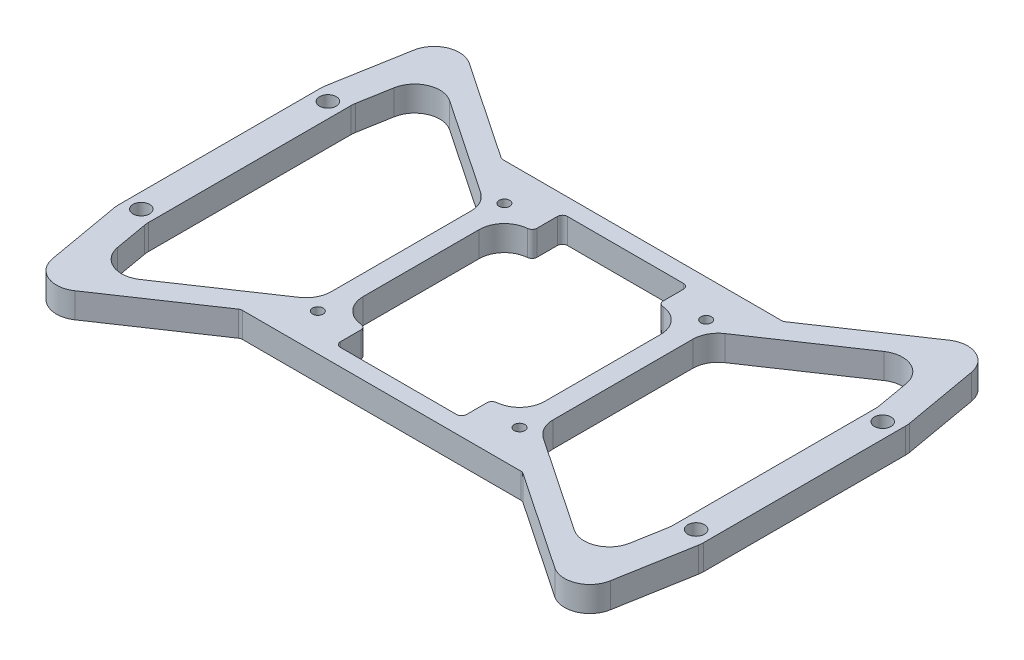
ISO-10303-21;
HEADER;
FILE_DESCRIPTION(('STEP AP214'),'2;1');
FILE_NAME('part.step','',(''),(''),'','','');
FILE_SCHEMA(('AUTOMOTIVE_DESIGN { 1 0 10303 214 1 1 1 1 }'));
ENDSEC;
DATA;
#1=APPLICATION_CONTEXT('core data for automotive mechanical design processes');
#2=APPLICATION_PROTOCOL_DEFINITION('international standard','automotive_design',2000,#1);
#3=PRODUCT_CONTEXT('',#1,'mechanical');
#4=PRODUCT('Part','Part','',(#3));
#5=PRODUCT_RELATED_PRODUCT_CATEGORY('part','',(#4));
#6=PRODUCT_DEFINITION_FORMATION('','',#4);
#7=PRODUCT_DEFINITION_CONTEXT('part definition',#1,'design');
#8=PRODUCT_DEFINITION('design','',#6,#7);
#9=PRODUCT_DEFINITION_SHAPE('','',#8);
#10=(LENGTH_UNIT() NAMED_UNIT(*) SI_UNIT(.MILLI.,.METRE.));
#11=(NAMED_UNIT(*) PLANE_ANGLE_UNIT() SI_UNIT($,.RADIAN.));
#12=(NAMED_UNIT(*) SI_UNIT($,.STERADIAN.) SOLID_ANGLE_UNIT());
#13=UNCERTAINTY_MEASURE_WITH_UNIT(LENGTH_MEASURE(1.E-05),#10,'distance_accuracy_value','');
#14=(GEOMETRIC_REPRESENTATION_CONTEXT(3) GLOBAL_UNCERTAINTY_ASSIGNED_CONTEXT((#13)) GLOBAL_UNIT_ASSIGNED_CONTEXT((#10,
#11,#12)) REPRESENTATION_CONTEXT('',''));
#15=CARTESIAN_POINT('',(0.,0.,0.));
#16=DIRECTION('',(0.,0.,1.));
#17=DIRECTION('',(1.,0.,0.));
#18=AXIS2_PLACEMENT_3D('',#15,#16,#17);
#19=CARTESIAN_POINT('',(0.,5.,0.));
#20=DIRECTION('',(0.,1.,0.));
#21=DIRECTION('',(0.,0.,1.));
#22=AXIS2_PLACEMENT_3D('',#19,#20,#21);
#23=PLANE('',#22);
#24=DIRECTION('',(0.829187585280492,0.,-0.558970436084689));
#25=VECTOR('',#24,1.);
#26=CARTESIAN_POINT('',(-0.773752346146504,5.,-1.1477992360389));
#27=LINE('',#26,#25);
#28=CARTESIAN_POINT('',(24.2051478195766,5.,-17.9865302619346));
#29=VERTEX_POINT('',#28);
#30=CARTESIAN_POINT('',(43.0609489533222,5.,-30.6975688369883));
#31=VERTEX_POINT('',#30);
#32=EDGE_CURVE('E1065',#29,#31,#27,.T.);
#33=ORIENTED_EDGE('',*,*,#32,.T.);
#34=CARTESIAN_POINT('',(45.8558011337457,5.,-26.5516309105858));
#35=DIRECTION('',(0.,1.,0.));
#36=DIRECTION('',(0.,0.,1.));
#37=AXIS2_PLACEMENT_3D('',#34,#35,#36);
#38=CIRCLE('',#37,5.);
#39=CARTESIAN_POINT('',(50.7798398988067,5.,-27.4198717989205));
#40=VERTEX_POINT('',#39);
#41=EDGE_CURVE('E756',#31,#40,#38,.F.);
#42=ORIENTED_EDGE('',*,*,#41,.T.);
#43=DIRECTION('',(0.173648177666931,0.,0.984807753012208));
#44=VECTOR('',#43,1.);
#45=CARTESIAN_POINT('',(53.9377146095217,5.,-9.51067436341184));
#46=LINE('',#45,#44);
#47=CARTESIAN_POINT('',(51.924038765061,5.,-20.930797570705));
#48=VERTEX_POINT('',#47);
#49=EDGE_CURVE('E1068',#40,#48,#46,.T.);
#50=ORIENTED_EDGE('',*,*,#49,.T.);
#51=CARTESIAN_POINT('',(47.,5.,-20.0625566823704));
#52=DIRECTION('',(0.,1.,0.));
#53=DIRECTION('',(0.,0.,1.));
#54=AXIS2_PLACEMENT_3D('',#51,#52,#53);
#55=CIRCLE('',#54,5.);
#56=CARTESIAN_POINT('',(52.,5.,-20.0625566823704));
#57=VERTEX_POINT('',#56);
#58=EDGE_CURVE('E762',#48,#57,#55,.F.);
#59=ORIENTED_EDGE('',*,*,#58,.T.);
#60=DIRECTION('',(0.,0.,1.));
#61=VECTOR('',#60,1.);
#62=CARTESIAN_POINT('',(52.,5.,0.));
#63=LINE('',#62,#61);
#64=CARTESIAN_POINT('',(52.,5.,20.0625566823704));
#65=VERTEX_POINT('',#64);
#66=EDGE_CURVE('E1072',#57,#65,#63,.T.);
#67=ORIENTED_EDGE('',*,*,#66,.T.);
#68=CARTESIAN_POINT('',(47.,5.,20.0625566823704));
#69=DIRECTION('',(0.,1.,0.));
#70=DIRECTION('',(0.,0.,1.));
#71=AXIS2_PLACEMENT_3D('',#68,#69,#70);
#72=CIRCLE('',#71,5.);
#73=CARTESIAN_POINT('',(51.924038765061,5.,20.930797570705));
#74=VERTEX_POINT('',#73);
#75=EDGE_CURVE('E768',#65,#74,#72,.F.);
#76=ORIENTED_EDGE('',*,*,#75,.T.);
#77=DIRECTION('',(0.17364817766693,0.,-0.984807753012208));
#78=VECTOR('',#77,1.);
#79=CARTESIAN_POINT('',(53.9377146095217,5.,9.51067436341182));
#80=LINE('',#79,#78);
#81=CARTESIAN_POINT('',(50.7798398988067,5.,27.4198717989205));
#82=VERTEX_POINT('',#81);
#83=EDGE_CURVE('E1076',#82,#74,#80,.T.);
#84=ORIENTED_EDGE('',*,*,#83,.F.);
#85=CARTESIAN_POINT('',(45.8558011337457,5.,26.5516309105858));
#86=DIRECTION('',(0.,1.,0.));
#87=DIRECTION('',(0.,0.,1.));
#88=AXIS2_PLACEMENT_3D('',#85,#86,#87);
#89=CIRCLE('',#88,5.);
#90=CARTESIAN_POINT('',(43.0609489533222,5.,30.6975688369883));
#91=VERTEX_POINT('',#90);
#92=EDGE_CURVE('E774',#82,#91,#89,.F.);
#93=ORIENTED_EDGE('',*,*,#92,.T.);
#94=DIRECTION('',(0.829187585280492,0.,0.558970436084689));
#95=VECTOR('',#94,1.);
#96=CARTESIAN_POINT('',(-0.773752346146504,5.,1.1477992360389));
#97=LINE('',#96,#95);
#98=CARTESIAN_POINT('',(24.2051478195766,5.,17.9865302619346));
#99=VERTEX_POINT('',#98);
#100=EDGE_CURVE('E1080',#99,#91,#97,.T.);
#101=ORIENTED_EDGE('',*,*,#100,.F.);
#102=CARTESIAN_POINT('',(27.,5.,13.8405923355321));
#103=DIRECTION('',(0.,1.,0.));
#104=DIRECTION('',(0.,0.,1.));
#105=AXIS2_PLACEMENT_3D('',#102,#103,#104);
#106=CIRCLE('',#105,5.);
#107=CARTESIAN_POINT('',(22.,5.,13.8405923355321));
#108=VERTEX_POINT('',#107);
#109=EDGE_CURVE('E743',#99,#108,#106,.F.);
#110=ORIENTED_EDGE('',*,*,#109,.T.);
#111=DIRECTION('',(0.,0.,1.));
#112=VECTOR('',#111,1.);
#113=CARTESIAN_POINT('',(22.,5.,0.));
#114=LINE('',#113,#112);
#115=CARTESIAN_POINT('',(22.,5.,-13.8405923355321));
#116=VERTEX_POINT('',#115);
#117=EDGE_CURVE('E1061',#116,#108,#114,.T.);
#118=ORIENTED_EDGE('',*,*,#117,.F.);
#119=CARTESIAN_POINT('',(27.,5.,-13.8405923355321));
#120=DIRECTION('',(0.,1.,0.));
#121=DIRECTION('',(0.,0.,1.));
#122=AXIS2_PLACEMENT_3D('',#119,#120,#121);
#123=CIRCLE('',#122,5.);
#124=EDGE_CURVE('E749',#116,#29,#123,.F.);
#125=ORIENTED_EDGE('',*,*,#124,.T.);
#126=EDGE_LOOP('',(#33,#42,#50,#59,#67,#76,#84,#93,#101,#110,#118,#125));
#127=FACE_BOUND('',#126,.T.);
#128=CARTESIAN_POINT('',(-45.8558011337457,5.,-26.5516309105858));
#129=DIRECTION('',(0.,1.,0.));
#130=DIRECTION('',(0.,0.,1.));
#131=AXIS2_PLACEMENT_3D('',#128,#129,#130);
#132=CIRCLE('',#131,5.);
#133=CARTESIAN_POINT('',(-50.7798398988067,5.,-27.4198717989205));
#134=VERTEX_POINT('',#133);
#135=CARTESIAN_POINT('',(-43.0609489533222,5.,-30.6975688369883));
#136=VERTEX_POINT('',#135);
#137=EDGE_CURVE('E724',#134,#136,#132,.F.);
#138=ORIENTED_EDGE('',*,*,#137,.T.);
#139=DIRECTION('',(-0.829187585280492,0.,-0.558970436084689));
#140=VECTOR('',#139,1.);
#141=CARTESIAN_POINT('',(0.773752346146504,5.,-1.1477992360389));
#142=LINE('',#141,#140);
#143=CARTESIAN_POINT('',(-24.2051478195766,5.,-17.9865302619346));
#144=VERTEX_POINT('',#143);
#145=EDGE_CURVE('E1040',#144,#136,#142,.T.);
#146=ORIENTED_EDGE('',*,*,#145,.F.);
#147=CARTESIAN_POINT('',(-27.,5.,-13.8405923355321));
#148=DIRECTION('',(0.,1.,0.));
#149=DIRECTION('',(0.,0.,1.));
#150=AXIS2_PLACEMENT_3D('',#147,#148,#149);
#151=CIRCLE('',#150,5.);
#152=CARTESIAN_POINT('',(-22.,5.,-13.8405923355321));
#153=VERTEX_POINT('',#152);
#154=EDGE_CURVE('E731',#144,#153,#151,.F.);
#155=ORIENTED_EDGE('',*,*,#154,.T.);
#156=DIRECTION('',(0.,0.,1.));
#157=VECTOR('',#156,1.);
#158=CARTESIAN_POINT('',(-22.,5.,0.));
#159=LINE('',#158,#157);
#160=CARTESIAN_POINT('',(-22.,5.,13.8405923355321));
#161=VERTEX_POINT('',#160);
#162=EDGE_CURVE('E1043',#153,#161,#159,.T.);
#163=ORIENTED_EDGE('',*,*,#162,.T.);
#164=CARTESIAN_POINT('',(-27.,5.,13.8405923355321));
#165=DIRECTION('',(0.,1.,0.));
#166=DIRECTION('',(0.,0.,1.));
#167=AXIS2_PLACEMENT_3D('',#164,#165,#166);
#168=CIRCLE('',#167,5.);
#169=CARTESIAN_POINT('',(-24.2051478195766,5.,17.9865302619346));
#170=VERTEX_POINT('',#169);
#171=EDGE_CURVE('E737',#161,#170,#168,.F.);
#172=ORIENTED_EDGE('',*,*,#171,.T.);
#173=DIRECTION('',(-0.829187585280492,0.,0.558970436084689));
#174=VECTOR('',#173,1.);
#175=CARTESIAN_POINT('',(0.773752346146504,5.,1.1477992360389));
#176=LINE('',#175,#174);
#177=CARTESIAN_POINT('',(-43.0609489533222,5.,30.6975688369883));
#178=VERTEX_POINT('',#177);
#179=EDGE_CURVE('E1047',#170,#178,#176,.T.);
#180=ORIENTED_EDGE('',*,*,#179,.T.);
#181=CARTESIAN_POINT('',(-45.8558011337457,5.,26.5516309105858));
#182=DIRECTION('',(0.,1.,0.));
#183=DIRECTION('',(0.,0.,1.));
#184=AXIS2_PLACEMENT_3D('',#181,#182,#183);
#185=CIRCLE('',#184,5.);
#186=CARTESIAN_POINT('',(-50.7798398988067,5.,27.4198717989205));
#187=VERTEX_POINT('',#186);
#188=EDGE_CURVE('E483',#178,#187,#185,.F.);
#189=ORIENTED_EDGE('',*,*,#188,.T.);
#190=DIRECTION('',(-0.17364817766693,0.,-0.984807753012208));
#191=VECTOR('',#190,1.);
#192=CARTESIAN_POINT('',(-53.9377146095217,5.,9.51067436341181));
#193=LINE('',#192,#191);
#194=CARTESIAN_POINT('',(-51.924038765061,5.,20.930797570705));
#195=VERTEX_POINT('',#194);
#196=EDGE_CURVE('E1050',#187,#195,#193,.T.);
#197=ORIENTED_EDGE('',*,*,#196,.T.);
#198=CARTESIAN_POINT('',(-47.,5.,20.0625566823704));
#199=DIRECTION('',(0.,1.,0.));
#200=DIRECTION('',(0.,0.,1.));
#201=AXIS2_PLACEMENT_3D('',#198,#199,#200);
#202=CIRCLE('',#201,5.);
#203=CARTESIAN_POINT('',(-52.,5.,20.0625566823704));
#204=VERTEX_POINT('',#203);
#205=EDGE_CURVE('E710',#195,#204,#202,.F.);
#206=ORIENTED_EDGE('',*,*,#205,.T.);
#207=DIRECTION('',(0.,0.,1.));
#208=VECTOR('',#207,1.);
#209=CARTESIAN_POINT('',(-52.,5.,0.));
#210=LINE('',#209,#208);
#211=CARTESIAN_POINT('',(-52.,5.,-20.0625566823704));
#212=VERTEX_POINT('',#211);
#213=EDGE_CURVE('E1054',#212,#204,#210,.T.);
#214=ORIENTED_EDGE('',*,*,#213,.F.);
#215=CARTESIAN_POINT('',(-47.,5.,-20.0625566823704));
#216=DIRECTION('',(0.,1.,0.));
#217=DIRECTION('',(0.,0.,1.));
#218=AXIS2_PLACEMENT_3D('',#215,#216,#217);
#219=CIRCLE('',#218,5.);
#220=CARTESIAN_POINT('',(-51.924038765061,5.,-20.930797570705));
#221=VERTEX_POINT('',#220);
#222=EDGE_CURVE('E482',#212,#221,#219,.F.);
#223=ORIENTED_EDGE('',*,*,#222,.T.);
#224=DIRECTION('',(-0.173648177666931,0.,0.984807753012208));
#225=VECTOR('',#224,1.);
#226=CARTESIAN_POINT('',(-53.9377146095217,5.,-9.51067436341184));
#227=LINE('',#226,#225);
#228=EDGE_CURVE('E1057',#134,#221,#227,.T.);
#229=ORIENTED_EDGE('',*,*,#228,.F.);
#230=EDGE_LOOP('',(#138,#146,#155,#163,#172,#180,#189,#197,#206,#214,#223,#229));
#231=FACE_BOUND('',#230,.T.);
#232=DIRECTION('',(-0.829187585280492,0.,0.558970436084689));
#233=VECTOR('',#232,1.);
#234=CARTESIAN_POINT('',(-3.25261362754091,5.,-4.82499013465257));
#235=LINE('',#234,#233);
#236=CARTESIAN_POINT('',(47.5806726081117,5.,-39.0926331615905));
#237=VERTEX_POINT('',#236);
#238=CARTESIAN_POINT('',(28.1870640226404,5.,-26.0190487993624));
#239=VERTEX_POINT('',#238);
#240=EDGE_CURVE('E1143',#237,#239,#235,.T.);
#241=ORIENTED_EDGE('',*,*,#240,.T.);
#242=CARTESIAN_POINT('',(27.6280935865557,5.,-26.8482363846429));
#243=DIRECTION('',(0.,1.,0.));
#244=DIRECTION('',(0.,0.,1.));
#245=AXIS2_PLACEMENT_3D('',#242,#243,#244);
#246=CIRCLE('',#245,1.);
#247=CARTESIAN_POINT('',(27.6280935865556,5.,-25.8482363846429));
#248=VERTEX_POINT('',#247);
#249=EDGE_CURVE('E943',#239,#248,#246,.F.);
#250=ORIENTED_EDGE('',*,*,#249,.T.);
#251=DIRECTION('',(1.,0.,0.));
#252=VECTOR('',#251,1.);
#253=CARTESIAN_POINT('',(-27.9336775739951,5.,-25.8482363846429));
#254=LINE('',#253,#252);
#255=CARTESIAN_POINT('',(-27.6280935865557,5.,-25.8482363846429));
#256=VERTEX_POINT('',#255);
#257=EDGE_CURVE('E987',#256,#248,#254,.T.);
#258=ORIENTED_EDGE('',*,*,#257,.F.);
#259=CARTESIAN_POINT('',(-27.6280935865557,5.,-26.8482363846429));
#260=DIRECTION('',(0.,1.,0.));
#261=DIRECTION('',(0.,0.,1.));
#262=AXIS2_PLACEMENT_3D('',#259,#260,#261);
#263=CIRCLE('',#262,1.);
#264=CARTESIAN_POINT('',(-28.1870640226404,5.,-26.0190487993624));
#265=VERTEX_POINT('',#264);
#266=EDGE_CURVE('E937',#256,#265,#263,.F.);
#267=ORIENTED_EDGE('',*,*,#266,.T.);
#268=DIRECTION('',(0.829187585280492,0.,0.558970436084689));
#269=VECTOR('',#268,1.);
#270=CARTESIAN_POINT('',(3.25261362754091,5.,-4.82499013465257));
#271=LINE('',#270,#269);
#272=CARTESIAN_POINT('',(-47.5806726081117,5.,-39.0926331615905));
#273=VERTEX_POINT('',#272);
#274=EDGE_CURVE('E506',#273,#265,#271,.T.);
#275=ORIENTED_EDGE('',*,*,#274,.F.);
#276=CARTESIAN_POINT('',(-50.3755247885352,5.,-34.9466952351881));
#277=DIRECTION('',(0.,1.,0.));
#278=DIRECTION('',(0.,0.,1.));
#279=AXIS2_PLACEMENT_3D('',#276,#277,#278);
#280=CIRCLE('',#279,5.);
#281=CARTESIAN_POINT('',(-55.2995635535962,5.,-35.8149361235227));
#282=VERTEX_POINT('',#281);
#283=EDGE_CURVE('E650',#273,#282,#280,.T.);
#284=ORIENTED_EDGE('',*,*,#283,.T.);
#285=DIRECTION('',(0.173648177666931,0.,-0.984807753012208));
#286=VECTOR('',#285,1.);
#287=CARTESIAN_POINT('',(-59.7567924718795,5.,-10.5367347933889));
#288=LINE('',#287,#286);
#289=CARTESIAN_POINT('',(-57.924038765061,5.,-20.930797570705));
#290=VERTEX_POINT('',#289);
#291=EDGE_CURVE('E499',#290,#282,#288,.T.);
#292=ORIENTED_EDGE('',*,*,#291,.F.);
#293=CARTESIAN_POINT('',(-53.,5.,-20.0625566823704));
#294=DIRECTION('',(0.,1.,0.));
#295=DIRECTION('',(0.,0.,1.));
#296=AXIS2_PLACEMENT_3D('',#293,#294,#295);
#297=CIRCLE('',#296,5.);
#298=CARTESIAN_POINT('',(-58.,5.,-20.0625566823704));
#299=VERTEX_POINT('',#298);
#300=EDGE_CURVE('E647',#290,#299,#297,.T.);
#301=ORIENTED_EDGE('',*,*,#300,.T.);
#302=DIRECTION('',(0.,0.,1.));
#303=VECTOR('',#302,1.);
#304=CARTESIAN_POINT('',(-58.,5.,0.));
#305=LINE('',#304,#303);
#306=CARTESIAN_POINT('',(-58.,5.,20.0625566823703));
#307=VERTEX_POINT('',#306);
#308=EDGE_CURVE('E1115',#299,#307,#305,.T.);
#309=ORIENTED_EDGE('',*,*,#308,.T.);
#310=CARTESIAN_POINT('',(-53.,5.,20.0625566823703));
#311=DIRECTION('',(0.,1.,0.));
#312=DIRECTION('',(0.,0.,1.));
#313=AXIS2_PLACEMENT_3D('',#310,#311,#312);
#314=CIRCLE('',#313,5.);
#315=CARTESIAN_POINT('',(-57.924038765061,5.,20.930797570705));
#316=VERTEX_POINT('',#315);
#317=EDGE_CURVE('E644',#307,#316,#314,.T.);
#318=ORIENTED_EDGE('',*,*,#317,.T.);
#319=DIRECTION('',(0.173648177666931,0.,0.984807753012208));
#320=VECTOR('',#319,1.);
#321=CARTESIAN_POINT('',(-59.7567924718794,5.,10.5367347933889));
#322=LINE('',#321,#320);
#323=CARTESIAN_POINT('',(-55.2995635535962,5.,35.8149361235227));
#324=VERTEX_POINT('',#323);
#325=EDGE_CURVE('E1119',#316,#324,#322,.T.);
#326=ORIENTED_EDGE('',*,*,#325,.T.);
#327=CARTESIAN_POINT('',(-50.3755247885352,5.,34.9466952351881));
#328=DIRECTION('',(0.,1.,0.));
#329=DIRECTION('',(0.,0.,1.));
#330=AXIS2_PLACEMENT_3D('',#327,#328,#329);
#331=CIRCLE('',#330,5.);
#332=CARTESIAN_POINT('',(-47.5806726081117,5.,39.0926331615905));
#333=VERTEX_POINT('',#332);
#334=EDGE_CURVE('E641',#324,#333,#331,.T.);
#335=ORIENTED_EDGE('',*,*,#334,.T.);
#336=DIRECTION('',(0.829187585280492,0.,-0.558970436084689));
#337=VECTOR('',#336,1.);
#338=CARTESIAN_POINT('',(3.25261362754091,5.,4.82499013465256));
#339=LINE('',#338,#337);
#340=CARTESIAN_POINT('',(-28.1870640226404,5.,26.0190487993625));
#341=VERTEX_POINT('',#340);
#342=EDGE_CURVE('E1123',#333,#341,#339,.T.);
#343=ORIENTED_EDGE('',*,*,#342,.T.);
#344=CARTESIAN_POINT('',(-27.6280935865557,5.,26.8482363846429));
#345=DIRECTION('',(0.,1.,0.));
#346=DIRECTION('',(0.,0.,1.));
#347=AXIS2_PLACEMENT_3D('',#344,#345,#346);
#348=CIRCLE('',#347,1.);
#349=CARTESIAN_POINT('',(-27.6280935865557,5.,25.8482363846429));
#350=VERTEX_POINT('',#349);
#351=EDGE_CURVE('E866',#341,#350,#348,.F.);
#352=ORIENTED_EDGE('',*,*,#351,.T.);
#353=DIRECTION('',(1.,0.,0.));
#354=VECTOR('',#353,1.);
#355=CARTESIAN_POINT('',(-27.9336775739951,5.,25.8482363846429));
#356=LINE('',#355,#354);
#357=CARTESIAN_POINT('',(27.6280935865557,5.,25.8482363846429));
#358=VERTEX_POINT('',#357);
#359=EDGE_CURVE('E1013',#350,#358,#356,.T.);
#360=ORIENTED_EDGE('',*,*,#359,.T.);
#361=CARTESIAN_POINT('',(27.6280935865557,5.,26.8482363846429));
#362=DIRECTION('',(0.,1.,0.));
#363=DIRECTION('',(0.,0.,1.));
#364=AXIS2_PLACEMENT_3D('',#361,#362,#363);
#365=CIRCLE('',#364,1.);
#366=CARTESIAN_POINT('',(28.1870640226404,5.,26.0190487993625));
#367=VERTEX_POINT('',#366);
#368=EDGE_CURVE('E860',#358,#367,#365,.F.);
#369=ORIENTED_EDGE('',*,*,#368,.T.);
#370=DIRECTION('',(-0.829187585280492,0.,-0.558970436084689));
#371=VECTOR('',#370,1.);
#372=CARTESIAN_POINT('',(-3.2526136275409,5.,4.82499013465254));
#373=LINE('',#372,#371);
#374=CARTESIAN_POINT('',(47.5806726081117,5.,39.0926331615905));
#375=VERTEX_POINT('',#374);
#376=EDGE_CURVE('E1127',#375,#367,#373,.T.);
#377=ORIENTED_EDGE('',*,*,#376,.F.);
#378=CARTESIAN_POINT('',(50.3755247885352,5.,34.9466952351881));
#379=DIRECTION('',(0.,1.,0.));
#380=DIRECTION('',(0.,0.,1.));
#381=AXIS2_PLACEMENT_3D('',#378,#379,#380);
#382=CIRCLE('',#381,5.);
#383=CARTESIAN_POINT('',(55.2995635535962,5.,35.8149361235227));
#384=VERTEX_POINT('',#383);
#385=EDGE_CURVE('E662',#375,#384,#382,.T.);
#386=ORIENTED_EDGE('',*,*,#385,.T.);
#387=DIRECTION('',(-0.173648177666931,0.,0.984807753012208));
#388=VECTOR('',#387,1.);
#389=CARTESIAN_POINT('',(59.7567924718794,5.,10.5367347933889));
#390=LINE('',#389,#388);
#391=CARTESIAN_POINT('',(57.924038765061,5.,20.930797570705));
#392=VERTEX_POINT('',#391);
#393=EDGE_CURVE('E1131',#392,#384,#390,.T.);
#394=ORIENTED_EDGE('',*,*,#393,.F.);
#395=CARTESIAN_POINT('',(53.,5.,20.0625566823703));
#396=DIRECTION('',(0.,1.,0.));
#397=DIRECTION('',(0.,0.,1.));
#398=AXIS2_PLACEMENT_3D('',#395,#396,#397);
#399=CIRCLE('',#398,5.);
#400=CARTESIAN_POINT('',(58.,5.,20.0625566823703));
#401=VERTEX_POINT('',#400);
#402=EDGE_CURVE('E659',#392,#401,#399,.T.);
#403=ORIENTED_EDGE('',*,*,#402,.T.);
#404=DIRECTION('',(0.,0.,1.));
#405=VECTOR('',#404,1.);
#406=CARTESIAN_POINT('',(58.,5.,0.));
#407=LINE('',#406,#405);
#408=CARTESIAN_POINT('',(58.,5.,-20.0625566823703));
#409=VERTEX_POINT('',#408);
#410=EDGE_CURVE('E1135',#409,#401,#407,.T.);
#411=ORIENTED_EDGE('',*,*,#410,.F.);
#412=CARTESIAN_POINT('',(53.,5.,-20.0625566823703));
#413=DIRECTION('',(0.,1.,0.));
#414=DIRECTION('',(0.,0.,1.));
#415=AXIS2_PLACEMENT_3D('',#412,#413,#414);
#416=CIRCLE('',#415,5.);
#417=CARTESIAN_POINT('',(57.924038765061,5.,-20.930797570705));
#418=VERTEX_POINT('',#417);
#419=EDGE_CURVE('E656',#409,#418,#416,.T.);
#420=ORIENTED_EDGE('',*,*,#419,.T.);
#421=DIRECTION('',(-0.173648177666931,0.,-0.984807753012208));
#422=VECTOR('',#421,1.);
#423=CARTESIAN_POINT('',(59.7567924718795,5.,-10.5367347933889));
#424=LINE('',#423,#422);
#425=CARTESIAN_POINT('',(55.2995635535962,5.,-35.8149361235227));
#426=VERTEX_POINT('',#425);
#427=EDGE_CURVE('E1139',#418,#426,#424,.T.);
#428=ORIENTED_EDGE('',*,*,#427,.T.);
#429=CARTESIAN_POINT('',(50.3755247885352,5.,-34.9466952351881));
#430=DIRECTION('',(0.,1.,0.));
#431=DIRECTION('',(0.,0.,1.));
#432=AXIS2_PLACEMENT_3D('',#429,#430,#431);
#433=CIRCLE('',#432,5.);
#434=EDGE_CURVE('E653',#426,#237,#433,.T.);
#435=ORIENTED_EDGE('',*,*,#434,.T.);
#436=EDGE_LOOP('',(#241,#250,#258,#267,#275,#284,#292,#301,#309,#318,#326,#335,#343,#352,#360,
#369,#377,#386,#394,#403,#411,#420,#428,#435));
#437=FACE_BOUND('',#436,.T.);
#438=CARTESIAN_POINT('',(55.,5.,-18.5));
#439=DIRECTION('',(0.,1.,0.));
#440=DIRECTION('',(0.,0.,1.));
#441=AXIS2_PLACEMENT_3D('',#438,#439,#440);
#442=CIRCLE('',#441,1.65);
#443=CARTESIAN_POINT('',(55.,5.,-16.85));
#444=VERTEX_POINT('',#443);
#445=EDGE_CURVE('E1083',#444,#444,#442,.T.);
#446=ORIENTED_EDGE('',*,*,#445,.F.);
#447=EDGE_LOOP('',(#446));
#448=FACE_BOUND('',#447,.T.);
#449=CARTESIAN_POINT('',(55.,5.,18.5));
#450=DIRECTION('',(0.,1.,0.));
#451=DIRECTION('',(0.,0.,1.));
#452=AXIS2_PLACEMENT_3D('',#449,#450,#451);
#453=CIRCLE('',#452,1.65);
#454=CARTESIAN_POINT('',(55.,5.,20.15));
#455=VERTEX_POINT('',#454);
#456=EDGE_CURVE('E1087',#455,#455,#453,.T.);
#457=ORIENTED_EDGE('',*,*,#456,.F.);
#458=EDGE_LOOP('',(#457));
#459=FACE_BOUND('',#458,.T.);
#460=CARTESIAN_POINT('',(-55.,5.,18.5));
#461=DIRECTION('',(0.,1.,0.));
#462=DIRECTION('',(0.,0.,1.));
#463=AXIS2_PLACEMENT_3D('',#460,#461,#462);
#464=CIRCLE('',#463,1.65);
#465=CARTESIAN_POINT('',(-55.,5.,20.15));
#466=VERTEX_POINT('',#465);
#467=EDGE_CURVE('E1091',#466,#466,#464,.T.);
#468=ORIENTED_EDGE('',*,*,#467,.F.);
#469=EDGE_LOOP('',(#468));
#470=FACE_BOUND('',#469,.T.);
#471=CARTESIAN_POINT('',(-55.,5.,-18.5));
#472=DIRECTION('',(0.,1.,0.));
#473=DIRECTION('',(0.,0.,1.));
#474=AXIS2_PLACEMENT_3D('',#471,#472,#473);
#475=CIRCLE('',#474,1.65);
#476=CARTESIAN_POINT('',(-55.,5.,-16.85));
#477=VERTEX_POINT('',#476);
#478=EDGE_CURVE('E1095',#477,#477,#475,.T.);
#479=ORIENTED_EDGE('',*,*,#478,.F.);
#480=EDGE_LOOP('',(#479));
#481=FACE_BOUND('',#480,.T.);
#482=CARTESIAN_POINT('',(-20.,5.,18.5));
#483=DIRECTION('',(0.,1.,0.));
#484=DIRECTION('',(0.,0.,1.));
#485=AXIS2_PLACEMENT_3D('',#482,#483,#484);
#486=CIRCLE('',#485,1.05);
#487=CARTESIAN_POINT('',(-20.,5.,19.55));
#488=VERTEX_POINT('',#487);
#489=EDGE_CURVE('E1099',#488,#488,#486,.T.);
#490=ORIENTED_EDGE('',*,*,#489,.F.);
#491=EDGE_LOOP('',(#490));
#492=FACE_BOUND('',#491,.T.);
#493=CARTESIAN_POINT('',(20.,5.,18.5));
#494=DIRECTION('',(0.,1.,0.));
#495=DIRECTION('',(0.,0.,1.));
#496=AXIS2_PLACEMENT_3D('',#493,#494,#495);
#497=CIRCLE('',#496,1.05);
#498=CARTESIAN_POINT('',(20.,5.,19.55));
#499=VERTEX_POINT('',#498);
#500=EDGE_CURVE('E1103',#499,#499,#497,.T.);
#501=ORIENTED_EDGE('',*,*,#500,.F.);
#502=EDGE_LOOP('',(#501));
#503=FACE_BOUND('',#502,.T.);
#504=CARTESIAN_POINT('',(20.,5.,-18.5));
#505=DIRECTION('',(0.,1.,0.));
#506=DIRECTION('',(0.,0.,1.));
#507=AXIS2_PLACEMENT_3D('',#504,#505,#506);
#508=CIRCLE('',#507,1.05);
#509=CARTESIAN_POINT('',(20.,5.,-17.45));
#510=VERTEX_POINT('',#509);
#511=EDGE_CURVE('E1107',#510,#510,#508,.T.);
#512=ORIENTED_EDGE('',*,*,#511,.F.);
#513=EDGE_LOOP('',(#512));
#514=FACE_BOUND('',#513,.T.);
#515=CARTESIAN_POINT('',(-20.,5.,-18.5));
#516=DIRECTION('',(0.,1.,0.));
#517=DIRECTION('',(0.,0.,1.));
#518=AXIS2_PLACEMENT_3D('',#515,#516,#517);
#519=CIRCLE('',#518,1.05);
#520=CARTESIAN_POINT('',(-20.,5.,-17.45));
#521=VERTEX_POINT('',#520);
#522=EDGE_CURVE('E1111',#521,#521,#519,.T.);
#523=ORIENTED_EDGE('',*,*,#522,.F.);
#524=EDGE_LOOP('',(#523));
#525=FACE_BOUND('',#524,.T.);
#526=DIRECTION('',(0.,0.,1.));
#527=VECTOR('',#526,1.);
#528=CARTESIAN_POINT('',(12.5,5.,-16.5));
#529=LINE('',#528,#527);
#530=CARTESIAN_POINT('',(12.5,5.,-21.5));
#531=VERTEX_POINT('',#530);
#532=CARTESIAN_POINT('',(12.5,5.,-17.4791303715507));
#533=VERTEX_POINT('',#532);
#534=EDGE_CURVE('E972',#531,#533,#529,.T.);
#535=ORIENTED_EDGE('',*,*,#534,.T.);
#536=CARTESIAN_POINT('',(13.5,5.,-17.4791303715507));
#537=DIRECTION('',(0.,1.,0.));
#538=DIRECTION('',(0.,0.,1.));
#539=AXIS2_PLACEMENT_3D('',#536,#537,#538);
#540=CIRCLE('',#539,1.);
#541=CARTESIAN_POINT('',(13.4166666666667,5.,-16.4826086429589));
#542=VERTEX_POINT('',#541);
#543=EDGE_CURVE('E915',#533,#542,#540,.T.);
#544=ORIENTED_EDGE('',*,*,#543,.T.);
#545=CARTESIAN_POINT('',(13.,5.,-11.5));
#546=DIRECTION('',(0.,1.,0.));
#547=DIRECTION('',(0.,0.,1.));
#548=AXIS2_PLACEMENT_3D('',#545,#546,#547);
#549=CIRCLE('',#548,5.);
#550=CARTESIAN_POINT('',(18.,5.,-11.5));
#551=VERTEX_POINT('',#550);
#552=EDGE_CURVE('E789',#542,#551,#549,.F.);
#553=ORIENTED_EDGE('',*,*,#552,.T.);
#554=DIRECTION('',(0.,0.,1.));
#555=VECTOR('',#554,1.);
#556=CARTESIAN_POINT('',(18.,5.,0.));
#557=LINE('',#556,#555);
#558=CARTESIAN_POINT('',(18.,5.,11.5));
#559=VERTEX_POINT('',#558);
#560=EDGE_CURVE('E1032',#551,#559,#557,.T.);
#561=ORIENTED_EDGE('',*,*,#560,.T.);
#562=CARTESIAN_POINT('',(13.,5.,11.5));
#563=DIRECTION('',(0.,1.,0.));
#564=DIRECTION('',(0.,0.,1.));
#565=AXIS2_PLACEMENT_3D('',#562,#563,#564);
#566=CIRCLE('',#565,5.);
#567=CARTESIAN_POINT('',(13.4166666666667,5.,16.4826086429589));
#568=VERTEX_POINT('',#567);
#569=EDGE_CURVE('E795',#559,#568,#566,.F.);
#570=ORIENTED_EDGE('',*,*,#569,.T.);
#571=CARTESIAN_POINT('',(13.5,5.,17.4791303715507));
#572=DIRECTION('',(0.,1.,0.));
#573=DIRECTION('',(0.,0.,1.));
#574=AXIS2_PLACEMENT_3D('',#571,#572,#573);
#575=CIRCLE('',#574,1.);
#576=CARTESIAN_POINT('',(12.5,5.,17.4791303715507));
#577=VERTEX_POINT('',#576);
#578=EDGE_CURVE('E827',#568,#577,#575,.T.);
#579=ORIENTED_EDGE('',*,*,#578,.T.);
#580=DIRECTION('',(0.,0.,-1.));
#581=VECTOR('',#580,1.);
#582=CARTESIAN_POINT('',(12.5,5.,16.5));
#583=LINE('',#582,#581);
#584=CARTESIAN_POINT('',(12.5,5.,21.5));
#585=VERTEX_POINT('',#584);
#586=EDGE_CURVE('E1005',#585,#577,#583,.T.);
#587=ORIENTED_EDGE('',*,*,#586,.F.);
#588=CARTESIAN_POINT('',(11.5,5.,21.5));
#589=DIRECTION('',(0.,1.,0.));
#590=DIRECTION('',(0.,0.,1.));
#591=AXIS2_PLACEMENT_3D('',#588,#589,#590);
#592=CIRCLE('',#591,1.);
#593=CARTESIAN_POINT('',(11.5,5.,22.5));
#594=VERTEX_POINT('',#593);
#595=EDGE_CURVE('E878',#585,#594,#592,.F.);
#596=ORIENTED_EDGE('',*,*,#595,.T.);
#597=DIRECTION('',(1.,0.,0.));
#598=VECTOR('',#597,1.);
#599=CARTESIAN_POINT('',(-12.5,5.,22.5));
#600=LINE('',#599,#598);
#601=CARTESIAN_POINT('',(-11.5,5.,22.5));
#602=VERTEX_POINT('',#601);
#603=EDGE_CURVE('E1017',#602,#594,#600,.T.);
#604=ORIENTED_EDGE('',*,*,#603,.F.);
#605=CARTESIAN_POINT('',(-11.5,5.,21.5));
#606=DIRECTION('',(0.,1.,0.));
#607=DIRECTION('',(0.,0.,1.));
#608=AXIS2_PLACEMENT_3D('',#605,#606,#607);
#609=CIRCLE('',#608,1.);
#610=CARTESIAN_POINT('',(-12.5,5.,21.5));
#611=VERTEX_POINT('',#610);
#612=EDGE_CURVE('E872',#602,#611,#609,.F.);
#613=ORIENTED_EDGE('',*,*,#612,.T.);
#614=DIRECTION('',(0.,0.,1.));
#615=VECTOR('',#614,1.);
#616=CARTESIAN_POINT('',(-12.5,5.,16.5));
#617=LINE('',#616,#615);
#618=CARTESIAN_POINT('',(-12.5,5.,17.4791303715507));
#619=VERTEX_POINT('',#618);
#620=EDGE_CURVE('E996',#619,#611,#617,.T.);
#621=ORIENTED_EDGE('',*,*,#620,.F.);
#622=CARTESIAN_POINT('',(-13.5,5.,17.4791303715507));
#623=DIRECTION('',(0.,1.,0.));
#624=DIRECTION('',(0.,0.,1.));
#625=AXIS2_PLACEMENT_3D('',#622,#623,#624);
#626=CIRCLE('',#625,1.);
#627=CARTESIAN_POINT('',(-13.4166666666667,5.,16.4826086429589));
#628=VERTEX_POINT('',#627);
#629=EDGE_CURVE('E830',#619,#628,#626,.T.);
#630=ORIENTED_EDGE('',*,*,#629,.T.);
#631=CARTESIAN_POINT('',(-13.,5.,11.5));
#632=DIRECTION('',(0.,1.,0.));
#633=DIRECTION('',(0.,0.,1.));
#634=AXIS2_PLACEMENT_3D('',#631,#632,#633);
#635=CIRCLE('',#634,5.);
#636=CARTESIAN_POINT('',(-18.,5.,11.5));
#637=VERTEX_POINT('',#636);
#638=EDGE_CURVE('E803',#628,#637,#635,.F.);
#639=ORIENTED_EDGE('',*,*,#638,.T.);
#640=DIRECTION('',(0.,0.,1.));
#641=VECTOR('',#640,1.);
#642=CARTESIAN_POINT('',(-18.,5.,0.));
#643=LINE('',#642,#641);
#644=CARTESIAN_POINT('',(-18.,5.,-11.5));
#645=VERTEX_POINT('',#644);
#646=EDGE_CURVE('E1036',#645,#637,#643,.T.);
#647=ORIENTED_EDGE('',*,*,#646,.F.);
#648=CARTESIAN_POINT('',(-13.,5.,-11.5));
#649=DIRECTION('',(0.,1.,0.));
#650=DIRECTION('',(0.,0.,1.));
#651=AXIS2_PLACEMENT_3D('',#648,#649,#650);
#652=CIRCLE('',#651,5.);
#653=CARTESIAN_POINT('',(-13.4166666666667,5.,-16.4826086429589));
#654=VERTEX_POINT('',#653);
#655=EDGE_CURVE('E781',#645,#654,#652,.F.);
#656=ORIENTED_EDGE('',*,*,#655,.T.);
#657=CARTESIAN_POINT('',(-13.5,5.,-17.4791303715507));
#658=DIRECTION('',(0.,1.,0.));
#659=DIRECTION('',(0.,0.,1.));
#660=AXIS2_PLACEMENT_3D('',#657,#658,#659);
#661=CIRCLE('',#660,1.);
#662=CARTESIAN_POINT('',(-12.5,5.,-17.4791303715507));
#663=VERTEX_POINT('',#662);
#664=EDGE_CURVE('E912',#654,#663,#661,.T.);
#665=ORIENTED_EDGE('',*,*,#664,.T.);
#666=DIRECTION('',(0.,0.,-1.));
#667=VECTOR('',#666,1.);
#668=CARTESIAN_POINT('',(-12.5,5.,-16.5));
#669=LINE('',#668,#667);
#670=CARTESIAN_POINT('',(-12.5,5.,-21.5));
#671=VERTEX_POINT('',#670);
#672=EDGE_CURVE('E962',#663,#671,#669,.T.);
#673=ORIENTED_EDGE('',*,*,#672,.T.);
#674=CARTESIAN_POINT('',(-11.5,5.,-21.5));
#675=DIRECTION('',(0.,1.,0.));
#676=DIRECTION('',(0.,0.,1.));
#677=AXIS2_PLACEMENT_3D('',#674,#675,#676);
#678=CIRCLE('',#677,1.);
#679=CARTESIAN_POINT('',(-11.5,5.,-22.5));
#680=VERTEX_POINT('',#679);
#681=EDGE_CURVE('E54',#671,#680,#678,.F.);
#682=ORIENTED_EDGE('',*,*,#681,.T.);
#683=DIRECTION('',(1.,0.,0.));
#684=VECTOR('',#683,1.);
#685=CARTESIAN_POINT('',(-12.5,5.,-22.5));
#686=LINE('',#685,#684);
#687=CARTESIAN_POINT('',(11.5,5.,-22.5));
#688=VERTEX_POINT('',#687);
#689=EDGE_CURVE('E960',#680,#688,#686,.T.);
#690=ORIENTED_EDGE('',*,*,#689,.T.);
#691=CARTESIAN_POINT('',(11.5,5.,-21.5));
#692=DIRECTION('',(0.,1.,0.));
#693=DIRECTION('',(0.,0.,1.));
#694=AXIS2_PLACEMENT_3D('',#691,#692,#693);
#695=CIRCLE('',#694,1.);
#696=EDGE_CURVE('E949',#688,#531,#695,.F.);
#697=ORIENTED_EDGE('',*,*,#696,.T.);
#698=EDGE_LOOP('',(#535,#544,#553,#561,#570,#579,#587,#596,#604,#613,#621,#630,#639,#647,#656,
#665,#673,#682,#690,#697));
#699=FACE_BOUND('',#698,.T.);
#700=ADVANCED_FACE('F45',(#127,#231,#437,#448,#459,#470,#481,#492,#503,#514,#525,#699),#23,.T.);
#701=CARTESIAN_POINT('',(0.,0.,0.));
#702=DIRECTION('',(0.,1.,0.));
#703=DIRECTION('',(0.,0.,1.));
#704=AXIS2_PLACEMENT_3D('',#701,#702,#703);
#705=PLANE('',#704);
#706=CARTESIAN_POINT('',(-20.,0.,-18.5));
#707=DIRECTION('',(0.,1.,0.));
#708=DIRECTION('',(0.,0.,1.));
#709=AXIS2_PLACEMENT_3D('',#706,#707,#708);
#710=CIRCLE('',#709,1.05);
#711=CARTESIAN_POINT('',(-20.,0.,-17.45));
#712=VERTEX_POINT('',#711);
#713=EDGE_CURVE('E1222',#712,#712,#710,.T.);
#714=ORIENTED_EDGE('',*,*,#713,.T.);
#715=EDGE_LOOP('',(#714));
#716=FACE_BOUND('',#715,.T.);
#717=CARTESIAN_POINT('',(20.,0.,-18.5));
#718=DIRECTION('',(0.,1.,0.));
#719=DIRECTION('',(0.,0.,1.));
#720=AXIS2_PLACEMENT_3D('',#717,#718,#719);
#721=CIRCLE('',#720,1.05);
#722=CARTESIAN_POINT('',(20.,0.,-17.45));
#723=VERTEX_POINT('',#722);
#724=EDGE_CURVE('E1218',#723,#723,#721,.T.);
#725=ORIENTED_EDGE('',*,*,#724,.T.);
#726=EDGE_LOOP('',(#725));
#727=FACE_BOUND('',#726,.T.);
#728=CARTESIAN_POINT('',(20.,0.,18.5));
#729=DIRECTION('',(0.,1.,0.));
#730=DIRECTION('',(0.,0.,1.));
#731=AXIS2_PLACEMENT_3D('',#728,#729,#730);
#732=CIRCLE('',#731,1.05);
#733=CARTESIAN_POINT('',(20.,0.,19.55));
#734=VERTEX_POINT('',#733);
#735=EDGE_CURVE('E1214',#734,#734,#732,.T.);
#736=ORIENTED_EDGE('',*,*,#735,.T.);
#737=EDGE_LOOP('',(#736));
#738=FACE_BOUND('',#737,.T.);
#739=CARTESIAN_POINT('',(-20.,0.,18.5));
#740=DIRECTION('',(0.,1.,0.));
#741=DIRECTION('',(0.,0.,1.));
#742=AXIS2_PLACEMENT_3D('',#739,#740,#741);
#743=CIRCLE('',#742,1.05);
#744=CARTESIAN_POINT('',(-20.,0.,19.55));
#745=VERTEX_POINT('',#744);
#746=EDGE_CURVE('E1210',#745,#745,#743,.T.);
#747=ORIENTED_EDGE('',*,*,#746,.T.);
#748=EDGE_LOOP('',(#747));
#749=FACE_BOUND('',#748,.T.);
#750=CARTESIAN_POINT('',(-55.,0.,-18.5));
#751=DIRECTION('',(0.,1.,0.));
#752=DIRECTION('',(0.,0.,1.));
#753=AXIS2_PLACEMENT_3D('',#750,#751,#752);
#754=CIRCLE('',#753,1.65);
#755=CARTESIAN_POINT('',(-55.,0.,-16.85));
#756=VERTEX_POINT('',#755);
#757=EDGE_CURVE('E1206',#756,#756,#754,.T.);
#758=ORIENTED_EDGE('',*,*,#757,.T.);
#759=EDGE_LOOP('',(#758));
#760=FACE_BOUND('',#759,.T.);
#761=CARTESIAN_POINT('',(-55.,0.,18.5));
#762=DIRECTION('',(0.,1.,0.));
#763=DIRECTION('',(0.,0.,1.));
#764=AXIS2_PLACEMENT_3D('',#761,#762,#763);
#765=CIRCLE('',#764,1.65);
#766=CARTESIAN_POINT('',(-55.,0.,20.15));
#767=VERTEX_POINT('',#766);
#768=EDGE_CURVE('E1202',#767,#767,#765,.T.);
#769=ORIENTED_EDGE('',*,*,#768,.T.);
#770=EDGE_LOOP('',(#769));
#771=FACE_BOUND('',#770,.T.);
#772=CARTESIAN_POINT('',(55.,0.,18.5));
#773=DIRECTION('',(0.,1.,0.));
#774=DIRECTION('',(0.,0.,1.));
#775=AXIS2_PLACEMENT_3D('',#772,#773,#774);
#776=CIRCLE('',#775,1.65);
#777=CARTESIAN_POINT('',(55.,0.,20.15));
#778=VERTEX_POINT('',#777);
#779=EDGE_CURVE('E1198',#778,#778,#776,.T.);
#780=ORIENTED_EDGE('',*,*,#779,.T.);
#781=EDGE_LOOP('',(#780));
#782=FACE_BOUND('',#781,.T.);
#783=CARTESIAN_POINT('',(55.,0.,-18.5));
#784=DIRECTION('',(0.,1.,0.));
#785=DIRECTION('',(0.,0.,1.));
#786=AXIS2_PLACEMENT_3D('',#783,#784,#785);
#787=CIRCLE('',#786,1.65);
#788=CARTESIAN_POINT('',(55.,0.,-16.85));
#789=VERTEX_POINT('',#788);
#790=EDGE_CURVE('E1194',#789,#789,#787,.T.);
#791=ORIENTED_EDGE('',*,*,#790,.T.);
#792=EDGE_LOOP('',(#791));
#793=FACE_BOUND('',#792,.T.);
#794=DIRECTION('',(0.829187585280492,0.,0.558970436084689));
#795=VECTOR('',#794,1.);
#796=CARTESIAN_POINT('',(3.25261362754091,0.,-4.82499013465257));
#797=LINE('',#796,#795);
#798=CARTESIAN_POINT('',(-47.5806726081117,0.,-39.0926331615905));
#799=VERTEX_POINT('',#798);
#800=CARTESIAN_POINT('',(-28.1870640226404,0.,-26.0190487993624));
#801=VERTEX_POINT('',#800);
#802=EDGE_CURVE('E1257',#799,#801,#797,.T.);
#803=ORIENTED_EDGE('',*,*,#802,.T.);
#804=CARTESIAN_POINT('',(-27.6280935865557,0.,-26.8482363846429));
#805=DIRECTION('',(0.,1.,0.));
#806=DIRECTION('',(0.,0.,1.));
#807=AXIS2_PLACEMENT_3D('',#804,#805,#806);
#808=CIRCLE('',#807,1.);
#809=CARTESIAN_POINT('',(-27.6280935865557,0.,-25.8482363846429));
#810=VERTEX_POINT('',#809);
#811=EDGE_CURVE('E940',#801,#810,#808,.T.);
#812=ORIENTED_EDGE('',*,*,#811,.T.);
#813=DIRECTION('',(-1.,0.,0.));
#814=VECTOR('',#813,1.);
#815=CARTESIAN_POINT('',(-27.9336775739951,0.,-25.8482363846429));
#816=LINE('',#815,#814);
#817=CARTESIAN_POINT('',(27.6280935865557,0.,-25.8482363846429));
#818=VERTEX_POINT('',#817);
#819=EDGE_CURVE('E992',#818,#810,#816,.T.);
#820=ORIENTED_EDGE('',*,*,#819,.F.);
#821=CARTESIAN_POINT('',(27.6280935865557,0.,-26.8482363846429));
#822=DIRECTION('',(0.,1.,0.));
#823=DIRECTION('',(0.,0.,1.));
#824=AXIS2_PLACEMENT_3D('',#821,#822,#823);
#825=CIRCLE('',#824,1.);
#826=CARTESIAN_POINT('',(28.1870640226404,0.,-26.0190487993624));
#827=VERTEX_POINT('',#826);
#828=EDGE_CURVE('E946',#818,#827,#825,.T.);
#829=ORIENTED_EDGE('',*,*,#828,.T.);
#830=DIRECTION('',(-0.829187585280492,0.,0.558970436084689));
#831=VECTOR('',#830,1.);
#832=CARTESIAN_POINT('',(-3.25261362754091,0.,-4.82499013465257));
#833=LINE('',#832,#831);
#834=CARTESIAN_POINT('',(47.5806726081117,0.,-39.0926331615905));
#835=VERTEX_POINT('',#834);
#836=EDGE_CURVE('E1254',#835,#827,#833,.T.);
#837=ORIENTED_EDGE('',*,*,#836,.F.);
#838=CARTESIAN_POINT('',(50.3755247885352,0.,-34.9466952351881));
#839=DIRECTION('',(0.,1.,0.));
#840=DIRECTION('',(0.,0.,1.));
#841=AXIS2_PLACEMENT_3D('',#838,#839,#840);
#842=CIRCLE('',#841,5.);
#843=CARTESIAN_POINT('',(55.2995635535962,0.,-35.8149361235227));
#844=VERTEX_POINT('',#843);
#845=EDGE_CURVE('E629',#835,#844,#842,.F.);
#846=ORIENTED_EDGE('',*,*,#845,.T.);
#847=DIRECTION('',(-0.173648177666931,0.,-0.984807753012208));
#848=VECTOR('',#847,1.);
#849=CARTESIAN_POINT('',(59.7567924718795,0.,-10.5367347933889));
#850=LINE('',#849,#848);
#851=CARTESIAN_POINT('',(57.924038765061,0.,-20.930797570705));
#852=VERTEX_POINT('',#851);
#853=EDGE_CURVE('E1250',#852,#844,#850,.T.);
#854=ORIENTED_EDGE('',*,*,#853,.F.);
#855=CARTESIAN_POINT('',(53.,0.,-20.0625566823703));
#856=DIRECTION('',(0.,1.,0.));
#857=DIRECTION('',(0.,0.,1.));
#858=AXIS2_PLACEMENT_3D('',#855,#856,#857);
#859=CIRCLE('',#858,5.);
#860=CARTESIAN_POINT('',(58.,0.,-20.0625566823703));
#861=VERTEX_POINT('',#860);
#862=EDGE_CURVE('E632',#852,#861,#859,.F.);
#863=ORIENTED_EDGE('',*,*,#862,.T.);
#864=DIRECTION('',(0.,0.,1.));
#865=VECTOR('',#864,1.);
#866=CARTESIAN_POINT('',(58.,0.,0.));
#867=LINE('',#866,#865);
#868=CARTESIAN_POINT('',(58.,0.,20.0625566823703));
#869=VERTEX_POINT('',#868);
#870=EDGE_CURVE('E1246',#861,#869,#867,.T.);
#871=ORIENTED_EDGE('',*,*,#870,.T.);
#872=CARTESIAN_POINT('',(53.,0.,20.0625566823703));
#873=DIRECTION('',(0.,1.,0.));
#874=DIRECTION('',(0.,0.,1.));
#875=AXIS2_PLACEMENT_3D('',#872,#873,#874);
#876=CIRCLE('',#875,5.);
#877=CARTESIAN_POINT('',(57.924038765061,0.,20.930797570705));
#878=VERTEX_POINT('',#877);
#879=EDGE_CURVE('E635',#869,#878,#876,.F.);
#880=ORIENTED_EDGE('',*,*,#879,.T.);
#881=DIRECTION('',(-0.173648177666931,0.,0.984807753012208));
#882=VECTOR('',#881,1.);
#883=CARTESIAN_POINT('',(59.7567924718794,0.,10.5367347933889));
#884=LINE('',#883,#882);
#885=CARTESIAN_POINT('',(55.2995635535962,0.,35.8149361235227));
#886=VERTEX_POINT('',#885);
#887=EDGE_CURVE('E1242',#878,#886,#884,.T.);
#888=ORIENTED_EDGE('',*,*,#887,.T.);
#889=CARTESIAN_POINT('',(50.3755247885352,0.,34.9466952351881));
#890=DIRECTION('',(0.,1.,0.));
#891=DIRECTION('',(0.,0.,1.));
#892=AXIS2_PLACEMENT_3D('',#889,#890,#891);
#893=CIRCLE('',#892,5.);
#894=CARTESIAN_POINT('',(47.5806726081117,0.,39.0926331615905));
#895=VERTEX_POINT('',#894);
#896=EDGE_CURVE('E638',#886,#895,#893,.F.);
#897=ORIENTED_EDGE('',*,*,#896,.T.);
#898=DIRECTION('',(-0.829187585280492,0.,-0.558970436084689));
#899=VECTOR('',#898,1.);
#900=CARTESIAN_POINT('',(-3.2526136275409,0.,4.82499013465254));
#901=LINE('',#900,#899);
#902=CARTESIAN_POINT('',(28.1870640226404,0.,26.0190487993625));
#903=VERTEX_POINT('',#902);
#904=EDGE_CURVE('E1238',#895,#903,#901,.T.);
#905=ORIENTED_EDGE('',*,*,#904,.T.);
#906=CARTESIAN_POINT('',(27.6280935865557,0.,26.8482363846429));
#907=DIRECTION('',(0.,1.,0.));
#908=DIRECTION('',(0.,0.,1.));
#909=AXIS2_PLACEMENT_3D('',#906,#907,#908);
#910=CIRCLE('',#909,1.);
#911=CARTESIAN_POINT('',(27.6280935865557,0.,25.8482363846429));
#912=VERTEX_POINT('',#911);
#913=EDGE_CURVE('E863',#903,#912,#910,.T.);
#914=ORIENTED_EDGE('',*,*,#913,.T.);
#915=DIRECTION('',(-1.,0.,0.));
#916=VECTOR('',#915,1.);
#917=CARTESIAN_POINT('',(-27.9336775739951,0.,25.8482363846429));
#918=LINE('',#917,#916);
#919=CARTESIAN_POINT('',(-27.6280935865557,0.,25.8482363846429));
#920=VERTEX_POINT('',#919);
#921=EDGE_CURVE('E1027',#912,#920,#918,.T.);
#922=ORIENTED_EDGE('',*,*,#921,.T.);
#923=CARTESIAN_POINT('',(-27.6280935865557,0.,26.8482363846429));
#924=DIRECTION('',(0.,1.,0.));
#925=DIRECTION('',(0.,0.,1.));
#926=AXIS2_PLACEMENT_3D('',#923,#924,#925);
#927=CIRCLE('',#926,1.);
#928=CARTESIAN_POINT('',(-28.1870640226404,0.,26.0190487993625));
#929=VERTEX_POINT('',#928);
#930=EDGE_CURVE('E869',#920,#929,#927,.T.);
#931=ORIENTED_EDGE('',*,*,#930,.T.);
#932=DIRECTION('',(0.829187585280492,0.,-0.558970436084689));
#933=VECTOR('',#932,1.);
#934=CARTESIAN_POINT('',(3.25261362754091,0.,4.82499013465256));
#935=LINE('',#934,#933);
#936=CARTESIAN_POINT('',(-47.5806726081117,0.,39.0926331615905));
#937=VERTEX_POINT('',#936);
#938=EDGE_CURVE('E1234',#937,#929,#935,.T.);
#939=ORIENTED_EDGE('',*,*,#938,.F.);
#940=CARTESIAN_POINT('',(-50.3755247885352,0.,34.9466952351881));
#941=DIRECTION('',(0.,1.,0.));
#942=DIRECTION('',(0.,0.,1.));
#943=AXIS2_PLACEMENT_3D('',#940,#941,#942);
#944=CIRCLE('',#943,5.);
#945=CARTESIAN_POINT('',(-55.2995635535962,0.,35.8149361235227));
#946=VERTEX_POINT('',#945);
#947=EDGE_CURVE('E617',#937,#946,#944,.F.);
#948=ORIENTED_EDGE('',*,*,#947,.T.);
#949=DIRECTION('',(0.173648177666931,0.,0.984807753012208));
#950=VECTOR('',#949,1.);
#951=CARTESIAN_POINT('',(-59.7567924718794,0.,10.5367347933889));
#952=LINE('',#951,#950);
#953=CARTESIAN_POINT('',(-57.924038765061,0.,20.930797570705));
#954=VERTEX_POINT('',#953);
#955=EDGE_CURVE('E1230',#954,#946,#952,.T.);
#956=ORIENTED_EDGE('',*,*,#955,.F.);
#957=CARTESIAN_POINT('',(-53.,0.,20.0625566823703));
#958=DIRECTION('',(0.,1.,0.));
#959=DIRECTION('',(0.,0.,1.));
#960=AXIS2_PLACEMENT_3D('',#957,#958,#959);
#961=CIRCLE('',#960,5.);
#962=CARTESIAN_POINT('',(-58.,0.,20.0625566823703));
#963=VERTEX_POINT('',#962);
#964=EDGE_CURVE('E620',#954,#963,#961,.F.);
#965=ORIENTED_EDGE('',*,*,#964,.T.);
#966=DIRECTION('',(0.,0.,1.));
#967=VECTOR('',#966,1.);
#968=CARTESIAN_POINT('',(-58.,0.,0.));
#969=LINE('',#968,#967);
#970=CARTESIAN_POINT('',(-58.,0.,-20.0625566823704));
#971=VERTEX_POINT('',#970);
#972=EDGE_CURVE('E1226',#971,#963,#969,.T.);
#973=ORIENTED_EDGE('',*,*,#972,.F.);
#974=CARTESIAN_POINT('',(-53.,0.,-20.0625566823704));
#975=DIRECTION('',(0.,1.,0.));
#976=DIRECTION('',(0.,0.,1.));
#977=AXIS2_PLACEMENT_3D('',#974,#975,#976);
#978=CIRCLE('',#977,5.);
#979=CARTESIAN_POINT('',(-57.924038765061,0.,-20.930797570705));
#980=VERTEX_POINT('',#979);
#981=EDGE_CURVE('E623',#971,#980,#978,.F.);
#982=ORIENTED_EDGE('',*,*,#981,.T.);
#983=DIRECTION('',(0.173648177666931,0.,-0.984807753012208));
#984=VECTOR('',#983,1.);
#985=CARTESIAN_POINT('',(-59.7567924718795,0.,-10.5367347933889));
#986=LINE('',#985,#984);
#987=CARTESIAN_POINT('',(-55.2995635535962,0.,-35.8149361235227));
#988=VERTEX_POINT('',#987);
#989=EDGE_CURVE('E509',#980,#988,#986,.T.);
#990=ORIENTED_EDGE('',*,*,#989,.T.);
#991=CARTESIAN_POINT('',(-50.3755247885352,0.,-34.9466952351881));
#992=DIRECTION('',(0.,1.,0.));
#993=DIRECTION('',(0.,0.,1.));
#994=AXIS2_PLACEMENT_3D('',#991,#992,#993);
#995=CIRCLE('',#994,5.);
#996=EDGE_CURVE('E626',#988,#799,#995,.F.);
#997=ORIENTED_EDGE('',*,*,#996,.T.);
#998=EDGE_LOOP('',(#803,#812,#820,#829,#837,#846,#854,#863,#871,#880,#888,#897,#905,#914,#922,
#931,#939,#948,#956,#965,#973,#982,#990,#997));
#999=FACE_BOUND('',#998,.T.);
#1000=DIRECTION('',(-0.829187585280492,0.,-0.558970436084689));
#1001=VECTOR('',#1000,1.);
#1002=CARTESIAN_POINT('',(0.773752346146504,0.,-1.1477992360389));
#1003=LINE('',#1002,#1001);
#1004=CARTESIAN_POINT('',(-24.2051478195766,0.,-17.9865302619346));
#1005=VERTEX_POINT('',#1004);
#1006=CARTESIAN_POINT('',(-43.0609489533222,0.,-30.6975688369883));
#1007=VERTEX_POINT('',#1006);
#1008=EDGE_CURVE('E1157',#1005,#1007,#1003,.T.);
#1009=ORIENTED_EDGE('',*,*,#1008,.T.);
#1010=CARTESIAN_POINT('',(-45.8558011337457,0.,-26.5516309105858));
#1011=DIRECTION('',(0.,1.,0.));
#1012=DIRECTION('',(0.,0.,1.));
#1013=AXIS2_PLACEMENT_3D('',#1010,#1011,#1012);
#1014=CIRCLE('',#1013,5.);
#1015=CARTESIAN_POINT('',(-50.7798398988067,0.,-27.4198717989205));
#1016=VERTEX_POINT('',#1015);
#1017=EDGE_CURVE('E721',#1007,#1016,#1014,.T.);
#1018=ORIENTED_EDGE('',*,*,#1017,.T.);
#1019=DIRECTION('',(-0.173648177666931,0.,0.984807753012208));
#1020=VECTOR('',#1019,1.);
#1021=CARTESIAN_POINT('',(-53.9377146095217,0.,-9.51067436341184));
#1022=LINE('',#1021,#1020);
#1023=CARTESIAN_POINT('',(-51.924038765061,0.,-20.930797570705));
#1024=VERTEX_POINT('',#1023);
#1025=EDGE_CURVE('E476',#1016,#1024,#1022,.T.);
#1026=ORIENTED_EDGE('',*,*,#1025,.T.);
#1027=CARTESIAN_POINT('',(-47.,0.,-20.0625566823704));
#1028=DIRECTION('',(0.,1.,0.));
#1029=DIRECTION('',(0.,0.,1.));
#1030=AXIS2_PLACEMENT_3D('',#1027,#1028,#1029);
#1031=CIRCLE('',#1030,5.);
#1032=CARTESIAN_POINT('',(-52.,0.,-20.0625566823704));
#1033=VERTEX_POINT('',#1032);
#1034=EDGE_CURVE('E470',#1024,#1033,#1031,.T.);
#1035=ORIENTED_EDGE('',*,*,#1034,.T.);
#1036=DIRECTION('',(0.,0.,1.));
#1037=VECTOR('',#1036,1.);
#1038=CARTESIAN_POINT('',(-52.,0.,0.));
#1039=LINE('',#1038,#1037);
#1040=CARTESIAN_POINT('',(-52.,0.,20.0625566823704));
#1041=VERTEX_POINT('',#1040);
#1042=EDGE_CURVE('E474',#1033,#1041,#1039,.T.);
#1043=ORIENTED_EDGE('',*,*,#1042,.T.);
#1044=CARTESIAN_POINT('',(-47.,0.,20.0625566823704));
#1045=DIRECTION('',(0.,1.,0.));
#1046=DIRECTION('',(0.,0.,1.));
#1047=AXIS2_PLACEMENT_3D('',#1044,#1045,#1046);
#1048=CIRCLE('',#1047,5.);
#1049=CARTESIAN_POINT('',(-51.924038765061,0.,20.930797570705));
#1050=VERTEX_POINT('',#1049);
#1051=EDGE_CURVE('E707',#1041,#1050,#1048,.T.);
#1052=ORIENTED_EDGE('',*,*,#1051,.T.);
#1053=DIRECTION('',(-0.17364817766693,0.,-0.984807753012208));
#1054=VECTOR('',#1053,1.);
#1055=CARTESIAN_POINT('',(-53.9377146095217,0.,9.51067436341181));
#1056=LINE('',#1055,#1054);
#1057=CARTESIAN_POINT('',(-50.7798398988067,0.,27.4198717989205));
#1058=VERTEX_POINT('',#1057);
#1059=EDGE_CURVE('E494',#1058,#1050,#1056,.T.);
#1060=ORIENTED_EDGE('',*,*,#1059,.F.);
#1061=CARTESIAN_POINT('',(-45.8558011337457,0.,26.5516309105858));
#1062=DIRECTION('',(0.,1.,0.));
#1063=DIRECTION('',(0.,0.,1.));
#1064=AXIS2_PLACEMENT_3D('',#1061,#1062,#1063);
#1065=CIRCLE('',#1064,5.);
#1066=CARTESIAN_POINT('',(-43.0609489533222,0.,30.6975688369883));
#1067=VERTEX_POINT('',#1066);
#1068=EDGE_CURVE('E713',#1058,#1067,#1065,.T.);
#1069=ORIENTED_EDGE('',*,*,#1068,.T.);
#1070=DIRECTION('',(-0.829187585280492,0.,0.558970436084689));
#1071=VECTOR('',#1070,1.);
#1072=CARTESIAN_POINT('',(0.773752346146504,0.,1.1477992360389));
#1073=LINE('',#1072,#1071);
#1074=CARTESIAN_POINT('',(-24.2051478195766,0.,17.9865302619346));
#1075=VERTEX_POINT('',#1074);
#1076=EDGE_CURVE('E1164',#1075,#1067,#1073,.T.);
#1077=ORIENTED_EDGE('',*,*,#1076,.F.);
#1078=CARTESIAN_POINT('',(-27.,0.,13.8405923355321));
#1079=DIRECTION('',(0.,1.,0.));
#1080=DIRECTION('',(0.,0.,1.));
#1081=AXIS2_PLACEMENT_3D('',#1078,#1079,#1080);
#1082=CIRCLE('',#1081,5.);
#1083=CARTESIAN_POINT('',(-22.,0.,13.8405923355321));
#1084=VERTEX_POINT('',#1083);
#1085=EDGE_CURVE('E734',#1075,#1084,#1082,.T.);
#1086=ORIENTED_EDGE('',*,*,#1085,.T.);
#1087=DIRECTION('',(0.,0.,1.));
#1088=VECTOR('',#1087,1.);
#1089=CARTESIAN_POINT('',(-22.,0.,0.));
#1090=LINE('',#1089,#1088);
#1091=CARTESIAN_POINT('',(-22.,0.,-13.8405923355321));
#1092=VERTEX_POINT('',#1091);
#1093=EDGE_CURVE('E1160',#1092,#1084,#1090,.T.);
#1094=ORIENTED_EDGE('',*,*,#1093,.F.);
#1095=CARTESIAN_POINT('',(-27.,0.,-13.8405923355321));
#1096=DIRECTION('',(0.,1.,0.));
#1097=DIRECTION('',(0.,0.,1.));
#1098=AXIS2_PLACEMENT_3D('',#1095,#1096,#1097);
#1099=CIRCLE('',#1098,5.);
#1100=EDGE_CURVE('E728',#1092,#1005,#1099,.T.);
#1101=ORIENTED_EDGE('',*,*,#1100,.T.);
#1102=EDGE_LOOP('',(#1009,#1018,#1026,#1035,#1043,#1052,#1060,#1069,#1077,#1086,#1094,#1101));
#1103=FACE_BOUND('',#1102,.T.);
#1104=CARTESIAN_POINT('',(45.8558011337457,0.,-26.5516309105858));
#1105=DIRECTION('',(0.,1.,0.));
#1106=DIRECTION('',(0.,0.,1.));
#1107=AXIS2_PLACEMENT_3D('',#1104,#1105,#1106);
#1108=CIRCLE('',#1107,5.);
#1109=CARTESIAN_POINT('',(50.7798398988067,0.,-27.4198717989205));
#1110=VERTEX_POINT('',#1109);
#1111=CARTESIAN_POINT('',(43.0609489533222,0.,-30.6975688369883));
#1112=VERTEX_POINT('',#1111);
#1113=EDGE_CURVE('E752',#1110,#1112,#1108,.T.);
#1114=ORIENTED_EDGE('',*,*,#1113,.T.);
#1115=DIRECTION('',(0.829187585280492,0.,-0.558970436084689));
#1116=VECTOR('',#1115,1.);
#1117=CARTESIAN_POINT('',(-0.773752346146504,0.,-1.1477992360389));
#1118=LINE('',#1117,#1116);
#1119=CARTESIAN_POINT('',(24.2051478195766,0.,-17.9865302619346));
#1120=VERTEX_POINT('',#1119);
#1121=EDGE_CURVE('E1176',#1120,#1112,#1118,.T.);
#1122=ORIENTED_EDGE('',*,*,#1121,.F.);
#1123=CARTESIAN_POINT('',(27.,0.,-13.8405923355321));
#1124=DIRECTION('',(0.,1.,0.));
#1125=DIRECTION('',(0.,0.,1.));
#1126=AXIS2_PLACEMENT_3D('',#1123,#1124,#1125);
#1127=CIRCLE('',#1126,5.);
#1128=CARTESIAN_POINT('',(22.,0.,-13.8405923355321));
#1129=VERTEX_POINT('',#1128);
#1130=EDGE_CURVE('E746',#1120,#1129,#1127,.T.);
#1131=ORIENTED_EDGE('',*,*,#1130,.T.);
#1132=DIRECTION('',(0.,0.,1.));
#1133=VECTOR('',#1132,1.);
#1134=CARTESIAN_POINT('',(22.,0.,0.));
#1135=LINE('',#1134,#1133);
#1136=CARTESIAN_POINT('',(22.,0.,13.8405923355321));
#1137=VERTEX_POINT('',#1136);
#1138=EDGE_CURVE('E1172',#1129,#1137,#1135,.T.);
#1139=ORIENTED_EDGE('',*,*,#1138,.T.);
#1140=CARTESIAN_POINT('',(27.,0.,13.8405923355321));
#1141=DIRECTION('',(0.,1.,0.));
#1142=DIRECTION('',(0.,0.,1.));
#1143=AXIS2_PLACEMENT_3D('',#1140,#1141,#1142);
#1144=CIRCLE('',#1143,5.);
#1145=CARTESIAN_POINT('',(24.2051478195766,0.,17.9865302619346));
#1146=VERTEX_POINT('',#1145);
#1147=EDGE_CURVE('E740',#1137,#1146,#1144,.T.);
#1148=ORIENTED_EDGE('',*,*,#1147,.T.);
#1149=DIRECTION('',(0.829187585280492,0.,0.558970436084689));
#1150=VECTOR('',#1149,1.);
#1151=CARTESIAN_POINT('',(-0.773752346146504,0.,1.1477992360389));
#1152=LINE('',#1151,#1150);
#1153=CARTESIAN_POINT('',(43.0609489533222,0.,30.6975688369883));
#1154=VERTEX_POINT('',#1153);
#1155=EDGE_CURVE('E1191',#1146,#1154,#1152,.T.);
#1156=ORIENTED_EDGE('',*,*,#1155,.T.);
#1157=CARTESIAN_POINT('',(45.8558011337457,0.,26.5516309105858));
#1158=DIRECTION('',(0.,1.,0.));
#1159=DIRECTION('',(0.,0.,1.));
#1160=AXIS2_PLACEMENT_3D('',#1157,#1158,#1159);
#1161=CIRCLE('',#1160,5.);
#1162=CARTESIAN_POINT('',(50.7798398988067,0.,27.4198717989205));
#1163=VERTEX_POINT('',#1162);
#1164=EDGE_CURVE('E771',#1154,#1163,#1161,.T.);
#1165=ORIENTED_EDGE('',*,*,#1164,.T.);
#1166=DIRECTION('',(0.17364817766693,0.,-0.984807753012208));
#1167=VECTOR('',#1166,1.);
#1168=CARTESIAN_POINT('',(53.9377146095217,0.,9.51067436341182));
#1169=LINE('',#1168,#1167);
#1170=CARTESIAN_POINT('',(51.924038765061,0.,20.930797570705));
#1171=VERTEX_POINT('',#1170);
#1172=EDGE_CURVE('E1187',#1163,#1171,#1169,.T.);
#1173=ORIENTED_EDGE('',*,*,#1172,.T.);
#1174=CARTESIAN_POINT('',(47.,0.,20.0625566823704));
#1175=DIRECTION('',(0.,1.,0.));
#1176=DIRECTION('',(0.,0.,1.));
#1177=AXIS2_PLACEMENT_3D('',#1174,#1175,#1176);
#1178=CIRCLE('',#1177,5.);
#1179=CARTESIAN_POINT('',(52.,0.,20.0625566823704));
#1180=VERTEX_POINT('',#1179);
#1181=EDGE_CURVE('E765',#1171,#1180,#1178,.T.);
#1182=ORIENTED_EDGE('',*,*,#1181,.T.);
#1183=DIRECTION('',(0.,0.,1.));
#1184=VECTOR('',#1183,1.);
#1185=CARTESIAN_POINT('',(52.,0.,0.));
#1186=LINE('',#1185,#1184);
#1187=CARTESIAN_POINT('',(52.,0.,-20.0625566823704));
#1188=VERTEX_POINT('',#1187);
#1189=EDGE_CURVE('E1183',#1188,#1180,#1186,.T.);
#1190=ORIENTED_EDGE('',*,*,#1189,.F.);
#1191=CARTESIAN_POINT('',(47.,0.,-20.0625566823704));
#1192=DIRECTION('',(0.,1.,0.));
#1193=DIRECTION('',(0.,0.,1.));
#1194=AXIS2_PLACEMENT_3D('',#1191,#1192,#1193);
#1195=CIRCLE('',#1194,5.);
#1196=CARTESIAN_POINT('',(51.924038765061,0.,-20.930797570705));
#1197=VERTEX_POINT('',#1196);
#1198=EDGE_CURVE('E759',#1188,#1197,#1195,.T.);
#1199=ORIENTED_EDGE('',*,*,#1198,.T.);
#1200=DIRECTION('',(0.173648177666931,0.,0.984807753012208));
#1201=VECTOR('',#1200,1.);
#1202=CARTESIAN_POINT('',(53.9377146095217,0.,-9.51067436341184));
#1203=LINE('',#1202,#1201);
#1204=EDGE_CURVE('E1179',#1110,#1197,#1203,.T.);
#1205=ORIENTED_EDGE('',*,*,#1204,.F.);
#1206=EDGE_LOOP('',(#1114,#1122,#1131,#1139,#1148,#1156,#1165,#1173,#1182,#1190,#1199,#1205));
#1207=FACE_BOUND('',#1206,.T.);
#1208=CARTESIAN_POINT('',(13.,0.,-11.5));
#1209=DIRECTION('',(0.,1.,0.));
#1210=DIRECTION('',(0.,0.,1.));
#1211=AXIS2_PLACEMENT_3D('',#1208,#1209,#1210);
#1212=CIRCLE('',#1211,5.);
#1213=CARTESIAN_POINT('',(18.,0.,-11.5));
#1214=VERTEX_POINT('',#1213);
#1215=CARTESIAN_POINT('',(13.4166666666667,0.,-16.4826086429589));
#1216=VERTEX_POINT('',#1215);
#1217=EDGE_CURVE('E785',#1214,#1216,#1212,.T.);
#1218=ORIENTED_EDGE('',*,*,#1217,.T.);
#1219=CARTESIAN_POINT('',(13.5,0.,-17.4791303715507));
#1220=DIRECTION('',(0.,1.,0.));
#1221=DIRECTION('',(0.,0.,1.));
#1222=AXIS2_PLACEMENT_3D('',#1219,#1220,#1221);
#1223=CIRCLE('',#1222,1.);
#1224=CARTESIAN_POINT('',(12.5,0.,-17.4791303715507));
#1225=VERTEX_POINT('',#1224);
#1226=EDGE_CURVE('E923',#1216,#1225,#1223,.F.);
#1227=ORIENTED_EDGE('',*,*,#1226,.T.);
#1228=DIRECTION('',(0.,0.,1.));
#1229=VECTOR('',#1228,1.);
#1230=CARTESIAN_POINT('',(12.5,0.,-16.5));
#1231=LINE('',#1230,#1229);
#1232=CARTESIAN_POINT('',(12.5,0.,-21.5));
#1233=VERTEX_POINT('',#1232);
#1234=EDGE_CURVE('E978',#1233,#1225,#1231,.T.);
#1235=ORIENTED_EDGE('',*,*,#1234,.F.);
#1236=CARTESIAN_POINT('',(11.5,0.,-21.5));
#1237=DIRECTION('',(0.,1.,0.));
#1238=DIRECTION('',(0.,0.,1.));
#1239=AXIS2_PLACEMENT_3D('',#1236,#1237,#1238);
#1240=CIRCLE('',#1239,1.);
#1241=CARTESIAN_POINT('',(11.5,0.,-22.5));
#1242=VERTEX_POINT('',#1241);
#1243=EDGE_CURVE('E952',#1233,#1242,#1240,.T.);
#1244=ORIENTED_EDGE('',*,*,#1243,.T.);
#1245=DIRECTION('',(1.,0.,0.));
#1246=VECTOR('',#1245,1.);
#1247=CARTESIAN_POINT('',(-12.5,0.,-22.5));
#1248=LINE('',#1247,#1246);
#1249=CARTESIAN_POINT('',(-11.5,0.,-22.5));
#1250=VERTEX_POINT('',#1249);
#1251=EDGE_CURVE('E982',#1250,#1242,#1248,.T.);
#1252=ORIENTED_EDGE('',*,*,#1251,.F.);
#1253=CARTESIAN_POINT('',(-11.5,0.,-21.5));
#1254=DIRECTION('',(0.,1.,0.));
#1255=DIRECTION('',(0.,0.,1.));
#1256=AXIS2_PLACEMENT_3D('',#1253,#1254,#1255);
#1257=CIRCLE('',#1256,1.);
#1258=CARTESIAN_POINT('',(-12.5,0.,-21.5));
#1259=VERTEX_POINT('',#1258);
#1260=EDGE_CURVE('E11',#1250,#1259,#1257,.T.);
#1261=ORIENTED_EDGE('',*,*,#1260,.T.);
#1262=DIRECTION('',(0.,0.,-1.));
#1263=VECTOR('',#1262,1.);
#1264=CARTESIAN_POINT('',(-12.5,0.,-16.5));
#1265=LINE('',#1264,#1263);
#1266=CARTESIAN_POINT('',(-12.5,0.,-17.4791303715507));
#1267=VERTEX_POINT('',#1266);
#1268=EDGE_CURVE('E971',#1267,#1259,#1265,.T.);
#1269=ORIENTED_EDGE('',*,*,#1268,.F.);
#1270=CARTESIAN_POINT('',(-13.5,0.,-17.4791303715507));
#1271=DIRECTION('',(0.,1.,0.));
#1272=DIRECTION('',(0.,0.,1.));
#1273=AXIS2_PLACEMENT_3D('',#1270,#1271,#1272);
#1274=CIRCLE('',#1273,1.);
#1275=CARTESIAN_POINT('',(-13.4166666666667,0.,-16.4826086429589));
#1276=VERTEX_POINT('',#1275);
#1277=EDGE_CURVE('E61',#1267,#1276,#1274,.F.);
#1278=ORIENTED_EDGE('',*,*,#1277,.T.);
#1279=CARTESIAN_POINT('',(-13.,0.,-11.5));
#1280=DIRECTION('',(0.,1.,0.));
#1281=DIRECTION('',(0.,0.,1.));
#1282=AXIS2_PLACEMENT_3D('',#1279,#1280,#1281);
#1283=CIRCLE('',#1282,5.);
#1284=CARTESIAN_POINT('',(-18.,0.,-11.5));
#1285=VERTEX_POINT('',#1284);
#1286=EDGE_CURVE('E778',#1276,#1285,#1283,.T.);
#1287=ORIENTED_EDGE('',*,*,#1286,.T.);
#1288=DIRECTION('',(0.,0.,1.));
#1289=VECTOR('',#1288,1.);
#1290=CARTESIAN_POINT('',(-18.,0.,0.));
#1291=LINE('',#1290,#1289);
#1292=CARTESIAN_POINT('',(-18.,0.,11.5));
#1293=VERTEX_POINT('',#1292);
#1294=EDGE_CURVE('E1153',#1285,#1293,#1291,.T.);
#1295=ORIENTED_EDGE('',*,*,#1294,.T.);
#1296=CARTESIAN_POINT('',(-13.,0.,11.5));
#1297=DIRECTION('',(0.,1.,0.));
#1298=DIRECTION('',(0.,0.,1.));
#1299=AXIS2_PLACEMENT_3D('',#1296,#1297,#1298);
#1300=CIRCLE('',#1299,5.);
#1301=CARTESIAN_POINT('',(-13.4166666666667,0.,16.4826086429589));
#1302=VERTEX_POINT('',#1301);
#1303=EDGE_CURVE('E799',#1293,#1302,#1300,.T.);
#1304=ORIENTED_EDGE('',*,*,#1303,.T.);
#1305=CARTESIAN_POINT('',(-13.5,0.,17.4791303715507));
#1306=DIRECTION('',(0.,1.,0.));
#1307=DIRECTION('',(0.,0.,1.));
#1308=AXIS2_PLACEMENT_3D('',#1305,#1306,#1307);
#1309=CIRCLE('',#1308,1.);
#1310=CARTESIAN_POINT('',(-12.5,0.,17.4791303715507));
#1311=VERTEX_POINT('',#1310);
#1312=EDGE_CURVE('E839',#1302,#1311,#1309,.F.);
#1313=ORIENTED_EDGE('',*,*,#1312,.T.);
#1314=DIRECTION('',(0.,0.,1.));
#1315=VECTOR('',#1314,1.);
#1316=CARTESIAN_POINT('',(-12.5,0.,16.5));
#1317=LINE('',#1316,#1315);
#1318=CARTESIAN_POINT('',(-12.5,0.,21.5));
#1319=VERTEX_POINT('',#1318);
#1320=EDGE_CURVE('E1000',#1311,#1319,#1317,.T.);
#1321=ORIENTED_EDGE('',*,*,#1320,.T.);
#1322=CARTESIAN_POINT('',(-11.5,0.,21.5));
#1323=DIRECTION('',(0.,1.,0.));
#1324=DIRECTION('',(0.,0.,1.));
#1325=AXIS2_PLACEMENT_3D('',#1322,#1323,#1324);
#1326=CIRCLE('',#1325,1.);
#1327=CARTESIAN_POINT('',(-11.5,0.,22.5));
#1328=VERTEX_POINT('',#1327);
#1329=EDGE_CURVE('E875',#1319,#1328,#1326,.T.);
#1330=ORIENTED_EDGE('',*,*,#1329,.T.);
#1331=DIRECTION('',(1.,0.,0.));
#1332=VECTOR('',#1331,1.);
#1333=CARTESIAN_POINT('',(-12.5,0.,22.5));
#1334=LINE('',#1333,#1332);
#1335=CARTESIAN_POINT('',(11.5,0.,22.5));
#1336=VERTEX_POINT('',#1335);
#1337=EDGE_CURVE('E1004',#1328,#1336,#1334,.T.);
#1338=ORIENTED_EDGE('',*,*,#1337,.T.);
#1339=CARTESIAN_POINT('',(11.5,0.,21.5));
#1340=DIRECTION('',(0.,1.,0.));
#1341=DIRECTION('',(0.,0.,1.));
#1342=AXIS2_PLACEMENT_3D('',#1339,#1340,#1341);
#1343=CIRCLE('',#1342,1.);
#1344=CARTESIAN_POINT('',(12.5,0.,21.5));
#1345=VERTEX_POINT('',#1344);
#1346=EDGE_CURVE('E881',#1336,#1345,#1343,.T.);
#1347=ORIENTED_EDGE('',*,*,#1346,.T.);
#1348=DIRECTION('',(0.,0.,-1.));
#1349=VECTOR('',#1348,1.);
#1350=CARTESIAN_POINT('',(12.5,0.,16.5));
#1351=LINE('',#1350,#1349);
#1352=CARTESIAN_POINT('',(12.5,0.,17.4791303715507));
#1353=VERTEX_POINT('',#1352);
#1354=EDGE_CURVE('E1009',#1345,#1353,#1351,.T.);
#1355=ORIENTED_EDGE('',*,*,#1354,.T.);
#1356=CARTESIAN_POINT('',(13.5,0.,17.4791303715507));
#1357=DIRECTION('',(0.,1.,0.));
#1358=DIRECTION('',(0.,0.,1.));
#1359=AXIS2_PLACEMENT_3D('',#1356,#1357,#1358);
#1360=CIRCLE('',#1359,1.);
#1361=CARTESIAN_POINT('',(13.4166666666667,0.,16.4826086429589));
#1362=VERTEX_POINT('',#1361);
#1363=EDGE_CURVE('E836',#1353,#1362,#1360,.F.);
#1364=ORIENTED_EDGE('',*,*,#1363,.T.);
#1365=CARTESIAN_POINT('',(13.,0.,11.5));
#1366=DIRECTION('',(0.,1.,0.));
#1367=DIRECTION('',(0.,0.,1.));
#1368=AXIS2_PLACEMENT_3D('',#1365,#1366,#1367);
#1369=CIRCLE('',#1368,5.);
#1370=CARTESIAN_POINT('',(18.,0.,11.5));
#1371=VERTEX_POINT('',#1370);
#1372=EDGE_CURVE('E792',#1362,#1371,#1369,.T.);
#1373=ORIENTED_EDGE('',*,*,#1372,.T.);
#1374=DIRECTION('',(0.,0.,1.));
#1375=VECTOR('',#1374,1.);
#1376=CARTESIAN_POINT('',(18.,0.,0.));
#1377=LINE('',#1376,#1375);
#1378=EDGE_CURVE('E1031',#1214,#1371,#1377,.T.);
#1379=ORIENTED_EDGE('',*,*,#1378,.F.);
#1380=EDGE_LOOP('',(#1218,#1227,#1235,#1244,#1252,#1261,#1269,#1278,#1287,#1295,#1304,#1313,
#1321,#1330,#1338,#1347,#1355,#1364,#1373,#1379));
#1381=FACE_BOUND('',#1380,.T.);
#1382=ADVANCED_FACE('F472',(#716,#727,#738,#749,#760,#771,#782,#793,#999,#1103,#1207,#1381),
#705,.F.);
#1383=CARTESIAN_POINT('',(-3.25261362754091,5.,-4.82499013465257));
#1384=DIRECTION('',(0.558970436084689,0.,0.829187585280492));
#1385=DIRECTION('',(0.829187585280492,0.,-0.558970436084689));
#1386=AXIS2_PLACEMENT_3D('',#1383,#1384,#1385);
#1387=PLANE('',#1386);
#1388=ORIENTED_EDGE('',*,*,#836,.T.);
#1389=DIRECTION('',(0.,1.,0.));
#1390=VECTOR('',#1389,1.);
#1391=CARTESIAN_POINT('',(28.1870640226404,5.,-26.0190487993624));
#1392=LINE('',#1391,#1390);
#1393=EDGE_CURVE('E894',#827,#239,#1392,.T.);
#1394=ORIENTED_EDGE('',*,*,#1393,.T.);
#1395=ORIENTED_EDGE('',*,*,#240,.F.);
#1396=DIRECTION('',(0.,-1.,0.));
#1397=VECTOR('',#1396,1.);
#1398=CARTESIAN_POINT('',(47.5806726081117,5.,-39.0926331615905));
#1399=LINE('',#1398,#1397);
#1400=EDGE_CURVE('E679',#237,#835,#1399,.T.);
#1401=ORIENTED_EDGE('',*,*,#1400,.T.);
#1402=EDGE_LOOP('',(#1388,#1394,#1395,#1401));
#1403=FACE_BOUND('',#1402,.T.);
#1404=ADVANCED_FACE('F1351',(#1403),#1387,.F.);
#1405=CARTESIAN_POINT('',(3.25261362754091,5.,-4.82499013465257));
#1406=DIRECTION('',(0.558970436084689,0.,-0.829187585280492));
#1407=DIRECTION('',(-0.829187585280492,0.,-0.558970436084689));
#1408=AXIS2_PLACEMENT_3D('',#1405,#1406,#1407);
#1409=PLANE('',#1408);
#1410=ORIENTED_EDGE('',*,*,#274,.T.);
#1411=DIRECTION('',(0.,1.,0.));
#1412=VECTOR('',#1411,1.);
#1413=CARTESIAN_POINT('',(-28.1870640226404,5.,-26.0190487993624));
#1414=LINE('',#1413,#1412);
#1415=EDGE_CURVE('E891',#265,#801,#1414,.F.);
#1416=ORIENTED_EDGE('',*,*,#1415,.T.);
#1417=ORIENTED_EDGE('',*,*,#802,.F.);
#1418=DIRECTION('',(0.,-1.,0.));
#1419=VECTOR('',#1418,1.);
#1420=CARTESIAN_POINT('',(-47.5806726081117,5.,-39.0926331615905));
#1421=LINE('',#1420,#1419);
#1422=EDGE_CURVE('E683',#799,#273,#1421,.F.);
#1423=ORIENTED_EDGE('',*,*,#1422,.T.);
#1424=EDGE_LOOP('',(#1410,#1416,#1417,#1423));
#1425=FACE_BOUND('',#1424,.T.);
#1426=ADVANCED_FACE('F1369',(#1425),#1409,.T.);
#1427=CARTESIAN_POINT('',(-58.,5.,0.));
#1428=DIRECTION('',(1.,0.,0.));
#1429=DIRECTION('',(0.,0.,-1.));
#1430=AXIS2_PLACEMENT_3D('',#1427,#1428,#1429);
#1431=PLANE('',#1430);
#1432=ORIENTED_EDGE('',*,*,#308,.F.);
#1433=DIRECTION('',(0.,-1.,0.));
#1434=VECTOR('',#1433,1.);
#1435=CARTESIAN_POINT('',(-58.,0.,-20.0625566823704));
#1436=LINE('',#1435,#1434);
#1437=EDGE_CURVE('E696',#299,#971,#1436,.T.);
#1438=ORIENTED_EDGE('',*,*,#1437,.T.);
#1439=ORIENTED_EDGE('',*,*,#972,.T.);
#1440=DIRECTION('',(0.,-1.,0.));
#1441=VECTOR('',#1440,1.);
#1442=CARTESIAN_POINT('',(-58.,5.,20.0625566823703));
#1443=LINE('',#1442,#1441);
#1444=EDGE_CURVE('E693',#963,#307,#1443,.F.);
#1445=ORIENTED_EDGE('',*,*,#1444,.T.);
#1446=EDGE_LOOP('',(#1432,#1438,#1439,#1445));
#1447=FACE_BOUND('',#1446,.T.);
#1448=ADVANCED_FACE('F1281',(#1447),#1431,.F.);
#1449=CARTESIAN_POINT('',(-59.7567924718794,5.,10.5367347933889));
#1450=DIRECTION('',(0.984807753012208,0.,-0.173648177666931));
#1451=DIRECTION('',(-0.173648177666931,0.,-0.984807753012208));
#1452=AXIS2_PLACEMENT_3D('',#1449,#1450,#1451);
#1453=PLANE('',#1452);
#1454=ORIENTED_EDGE('',*,*,#325,.F.);
#1455=DIRECTION('',(0.,-1.,0.));
#1456=VECTOR('',#1455,1.);
#1457=CARTESIAN_POINT('',(-57.924038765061,5.,20.930797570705));
#1458=LINE('',#1457,#1456);
#1459=EDGE_CURVE('E703',#316,#954,#1458,.T.);
#1460=ORIENTED_EDGE('',*,*,#1459,.T.);
#1461=ORIENTED_EDGE('',*,*,#955,.T.);
#1462=DIRECTION('',(0.,-1.,0.));
#1463=VECTOR('',#1462,1.);
#1464=CARTESIAN_POINT('',(-55.2995635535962,5.,35.8149361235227));
#1465=LINE('',#1464,#1463);
#1466=EDGE_CURVE('E700',#946,#324,#1465,.F.);
#1467=ORIENTED_EDGE('',*,*,#1466,.T.);
#1468=EDGE_LOOP('',(#1454,#1460,#1461,#1467));
#1469=FACE_BOUND('',#1468,.T.);
#1470=ADVANCED_FACE('F1289',(#1469),#1453,.F.);
#1471=CARTESIAN_POINT('',(3.25261362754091,5.,4.82499013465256));
#1472=DIRECTION('',(-0.558970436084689,0.,-0.829187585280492));
#1473=DIRECTION('',(-0.829187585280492,0.,0.558970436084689));
#1474=AXIS2_PLACEMENT_3D('',#1471,#1472,#1473);
#1475=PLANE('',#1474);
#1476=ORIENTED_EDGE('',*,*,#938,.T.);
#1477=DIRECTION('',(0.,1.,0.));
#1478=VECTOR('',#1477,1.);
#1479=CARTESIAN_POINT('',(-28.1870640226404,5.,26.0190487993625));
#1480=LINE('',#1479,#1478);
#1481=EDGE_CURVE('E816',#929,#341,#1480,.T.);
#1482=ORIENTED_EDGE('',*,*,#1481,.T.);
#1483=ORIENTED_EDGE('',*,*,#342,.F.);
#1484=DIRECTION('',(0.,-1.,0.));
#1485=VECTOR('',#1484,1.);
#1486=CARTESIAN_POINT('',(-47.5806726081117,5.,39.0926331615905));
#1487=LINE('',#1486,#1485);
#1488=EDGE_CURVE('E603',#333,#937,#1487,.T.);
#1489=ORIENTED_EDGE('',*,*,#1488,.T.);
#1490=EDGE_LOOP('',(#1476,#1482,#1483,#1489));
#1491=FACE_BOUND('',#1490,.T.);
#1492=ADVANCED_FACE('F1297',(#1491),#1475,.F.);
#1493=CARTESIAN_POINT('',(-3.2526136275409,5.,4.82499013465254));
#1494=DIRECTION('',(-0.558970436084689,0.,0.829187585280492));
#1495=DIRECTION('',(0.829187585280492,0.,0.558970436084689));
#1496=AXIS2_PLACEMENT_3D('',#1493,#1494,#1495);
#1497=PLANE('',#1496);
#1498=ORIENTED_EDGE('',*,*,#376,.T.);
#1499=DIRECTION('',(0.,1.,0.));
#1500=VECTOR('',#1499,1.);
#1501=CARTESIAN_POINT('',(28.1870640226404,0.,26.0190487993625));
#1502=LINE('',#1501,#1500);
#1503=EDGE_CURVE('E813',#367,#903,#1502,.F.);
#1504=ORIENTED_EDGE('',*,*,#1503,.T.);
#1505=ORIENTED_EDGE('',*,*,#904,.F.);
#1506=DIRECTION('',(0.,-1.,0.));
#1507=VECTOR('',#1506,1.);
#1508=CARTESIAN_POINT('',(47.5806726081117,5.,39.0926331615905));
#1509=LINE('',#1508,#1507);
#1510=EDGE_CURVE('E607',#895,#375,#1509,.F.);
#1511=ORIENTED_EDGE('',*,*,#1510,.T.);
#1512=EDGE_LOOP('',(#1498,#1504,#1505,#1511));
#1513=FACE_BOUND('',#1512,.T.);
#1514=ADVANCED_FACE('F1316',(#1513),#1497,.T.);
#1515=CARTESIAN_POINT('',(59.7567924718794,5.,10.5367347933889));
#1516=DIRECTION('',(0.984807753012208,0.,0.173648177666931));
#1517=DIRECTION('',(0.173648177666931,0.,-0.984807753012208));
#1518=AXIS2_PLACEMENT_3D('',#1515,#1516,#1517);
#1519=PLANE('',#1518);
#1520=ORIENTED_EDGE('',*,*,#393,.T.);
#1521=DIRECTION('',(0.,-1.,0.));
#1522=VECTOR('',#1521,1.);
#1523=CARTESIAN_POINT('',(55.2995635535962,5.,35.8149361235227));
#1524=LINE('',#1523,#1522);
#1525=EDGE_CURVE('E613',#384,#886,#1524,.T.);
#1526=ORIENTED_EDGE('',*,*,#1525,.T.);
#1527=ORIENTED_EDGE('',*,*,#887,.F.);
#1528=DIRECTION('',(0.,-1.,0.));
#1529=VECTOR('',#1528,1.);
#1530=CARTESIAN_POINT('',(57.924038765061,5.,20.930797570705));
#1531=LINE('',#1530,#1529);
#1532=EDGE_CURVE('E610',#878,#392,#1531,.F.);
#1533=ORIENTED_EDGE('',*,*,#1532,.T.);
#1534=EDGE_LOOP('',(#1520,#1526,#1527,#1533));
#1535=FACE_BOUND('',#1534,.T.);
#1536=ADVANCED_FACE('F1325',(#1535),#1519,.T.);
#1537=CARTESIAN_POINT('',(58.,5.,0.));
#1538=DIRECTION('',(1.,0.,0.));
#1539=DIRECTION('',(0.,0.,-1.));
#1540=AXIS2_PLACEMENT_3D('',#1537,#1538,#1539);
#1541=PLANE('',#1540);
#1542=ORIENTED_EDGE('',*,*,#410,.T.);
#1543=DIRECTION('',(0.,-1.,0.));
#1544=VECTOR('',#1543,1.);
#1545=CARTESIAN_POINT('',(58.,5.,20.0625566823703));
#1546=LINE('',#1545,#1544);
#1547=EDGE_CURVE('E668',#401,#869,#1546,.T.);
#1548=ORIENTED_EDGE('',*,*,#1547,.T.);
#1549=ORIENTED_EDGE('',*,*,#870,.F.);
#1550=DIRECTION('',(0.,-1.,0.));
#1551=VECTOR('',#1550,1.);
#1552=CARTESIAN_POINT('',(58.,5.,-20.0625566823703));
#1553=LINE('',#1552,#1551);
#1554=EDGE_CURVE('E665',#861,#409,#1553,.F.);
#1555=ORIENTED_EDGE('',*,*,#1554,.T.);
#1556=EDGE_LOOP('',(#1542,#1548,#1549,#1555));
#1557=FACE_BOUND('',#1556,.T.);
#1558=ADVANCED_FACE('F1334',(#1557),#1541,.T.);
#1559=CARTESIAN_POINT('',(59.7567924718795,5.,-10.5367347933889));
#1560=DIRECTION('',(-0.984807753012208,0.,0.173648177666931));
#1561=DIRECTION('',(0.173648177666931,0.,0.984807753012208));
#1562=AXIS2_PLACEMENT_3D('',#1559,#1560,#1561);
#1563=PLANE('',#1562);
#1564=ORIENTED_EDGE('',*,*,#427,.F.);
#1565=DIRECTION('',(0.,-1.,0.));
#1566=VECTOR('',#1565,1.);
#1567=CARTESIAN_POINT('',(57.924038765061,0.,-20.930797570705));
#1568=LINE('',#1567,#1566);
#1569=EDGE_CURVE('E675',#418,#852,#1568,.T.);
#1570=ORIENTED_EDGE('',*,*,#1569,.T.);
#1571=ORIENTED_EDGE('',*,*,#853,.T.);
#1572=DIRECTION('',(0.,-1.,0.));
#1573=VECTOR('',#1572,1.);
#1574=CARTESIAN_POINT('',(55.2995635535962,5.,-35.8149361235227));
#1575=LINE('',#1574,#1573);
#1576=EDGE_CURVE('E672',#844,#426,#1575,.F.);
#1577=ORIENTED_EDGE('',*,*,#1576,.T.);
#1578=EDGE_LOOP('',(#1564,#1570,#1571,#1577));
#1579=FACE_BOUND('',#1578,.T.);
#1580=ADVANCED_FACE('F1343',(#1579),#1563,.F.);
#1581=CARTESIAN_POINT('',(22.,5.,0.));
#1582=DIRECTION('',(1.,0.,0.));
#1583=DIRECTION('',(0.,0.,-1.));
#1584=AXIS2_PLACEMENT_3D('',#1581,#1582,#1583);
#1585=PLANE('',#1584);
#1586=ORIENTED_EDGE('',*,*,#117,.T.);
#1587=DIRECTION('',(0.,-1.,0.));
#1588=VECTOR('',#1587,1.);
#1589=CARTESIAN_POINT('',(22.,0.,13.8405923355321));
#1590=LINE('',#1589,#1588);
#1591=EDGE_CURVE('E549',#108,#1137,#1590,.T.);
#1592=ORIENTED_EDGE('',*,*,#1591,.T.);
#1593=ORIENTED_EDGE('',*,*,#1138,.F.);
#1594=DIRECTION('',(0.,-1.,0.));
#1595=VECTOR('',#1594,1.);
#1596=CARTESIAN_POINT('',(22.,5.,-13.8405923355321));
#1597=LINE('',#1596,#1595);
#1598=EDGE_CURVE('E546',#1129,#116,#1597,.F.);
#1599=ORIENTED_EDGE('',*,*,#1598,.T.);
#1600=EDGE_LOOP('',(#1586,#1592,#1593,#1599));
#1601=FACE_BOUND('',#1600,.T.);
#1602=ADVANCED_FACE('F1403',(#1601),#1585,.T.);
#1603=CARTESIAN_POINT('',(-0.773752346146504,5.,-1.1477992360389));
#1604=DIRECTION('',(-0.558970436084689,0.,-0.829187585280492));
#1605=DIRECTION('',(-0.829187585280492,0.,0.558970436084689));
#1606=AXIS2_PLACEMENT_3D('',#1603,#1604,#1605);
#1607=PLANE('',#1606);
#1608=ORIENTED_EDGE('',*,*,#1121,.T.);
#1609=DIRECTION('',(0.,-1.,0.));
#1610=VECTOR('',#1609,1.);
#1611=CARTESIAN_POINT('',(43.0609489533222,5.,-30.6975688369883));
#1612=LINE('',#1611,#1610);
#1613=EDGE_CURVE('E560',#1112,#31,#1612,.F.);
#1614=ORIENTED_EDGE('',*,*,#1613,.T.);
#1615=ORIENTED_EDGE('',*,*,#32,.F.);
#1616=DIRECTION('',(0.,-1.,0.));
#1617=VECTOR('',#1616,1.);
#1618=CARTESIAN_POINT('',(24.2051478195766,5.,-17.9865302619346));
#1619=LINE('',#1618,#1617);
#1620=EDGE_CURVE('E564',#29,#1120,#1619,.T.);
#1621=ORIENTED_EDGE('',*,*,#1620,.T.);
#1622=EDGE_LOOP('',(#1608,#1614,#1615,#1621));
#1623=FACE_BOUND('',#1622,.T.);
#1624=ADVANCED_FACE('F1466',(#1623),#1607,.F.);
#1625=CARTESIAN_POINT('',(53.9377146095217,5.,-9.51067436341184));
#1626=DIRECTION('',(0.984807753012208,0.,-0.173648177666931));
#1627=DIRECTION('',(-0.173648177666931,0.,-0.984807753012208));
#1628=AXIS2_PLACEMENT_3D('',#1625,#1626,#1627);
#1629=PLANE('',#1628);
#1630=ORIENTED_EDGE('',*,*,#49,.F.);
#1631=DIRECTION('',(0.,-1.,0.));
#1632=VECTOR('',#1631,1.);
#1633=CARTESIAN_POINT('',(50.7798398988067,0.,-27.4198717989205));
#1634=LINE('',#1633,#1632);
#1635=EDGE_CURVE('E571',#40,#1110,#1634,.T.);
#1636=ORIENTED_EDGE('',*,*,#1635,.T.);
#1637=ORIENTED_EDGE('',*,*,#1204,.T.);
#1638=DIRECTION('',(0.,-1.,0.));
#1639=VECTOR('',#1638,1.);
#1640=CARTESIAN_POINT('',(51.924038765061,5.,-20.930797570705));
#1641=LINE('',#1640,#1639);
#1642=EDGE_CURVE('E568',#1197,#48,#1641,.F.);
#1643=ORIENTED_EDGE('',*,*,#1642,.T.);
#1644=EDGE_LOOP('',(#1630,#1636,#1637,#1643));
#1645=FACE_BOUND('',#1644,.T.);
#1646=ADVANCED_FACE('F1462',(#1645),#1629,.F.);
#1647=CARTESIAN_POINT('',(52.,5.,0.));
#1648=DIRECTION('',(1.,0.,0.));
#1649=DIRECTION('',(0.,0.,-1.));
#1650=AXIS2_PLACEMENT_3D('',#1647,#1648,#1649);
#1651=PLANE('',#1650);
#1652=ORIENTED_EDGE('',*,*,#66,.F.);
#1653=DIRECTION('',(0.,-1.,0.));
#1654=VECTOR('',#1653,1.);
#1655=CARTESIAN_POINT('',(52.,0.,-20.0625566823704));
#1656=LINE('',#1655,#1654);
#1657=EDGE_CURVE('E578',#57,#1188,#1656,.T.);
#1658=ORIENTED_EDGE('',*,*,#1657,.T.);
#1659=ORIENTED_EDGE('',*,*,#1189,.T.);
#1660=DIRECTION('',(0.,-1.,0.));
#1661=VECTOR('',#1660,1.);
#1662=CARTESIAN_POINT('',(52.,5.,20.0625566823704));
#1663=LINE('',#1662,#1661);
#1664=EDGE_CURVE('E575',#1180,#65,#1663,.F.);
#1665=ORIENTED_EDGE('',*,*,#1664,.T.);
#1666=EDGE_LOOP('',(#1652,#1658,#1659,#1665));
#1667=FACE_BOUND('',#1666,.T.);
#1668=ADVANCED_FACE('F1458',(#1667),#1651,.F.);
#1669=CARTESIAN_POINT('',(53.9377146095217,5.,9.51067436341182));
#1670=DIRECTION('',(-0.984807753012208,0.,-0.17364817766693));
#1671=DIRECTION('',(-0.17364817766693,0.,0.984807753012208));
#1672=AXIS2_PLACEMENT_3D('',#1669,#1670,#1671);
#1673=PLANE('',#1672);
#1674=ORIENTED_EDGE('',*,*,#83,.T.);
#1675=DIRECTION('',(0.,-1.,0.));
#1676=VECTOR('',#1675,1.);
#1677=CARTESIAN_POINT('',(51.924038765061,5.,20.930797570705));
#1678=LINE('',#1677,#1676);
#1679=EDGE_CURVE('E585',#74,#1171,#1678,.T.);
#1680=ORIENTED_EDGE('',*,*,#1679,.T.);
#1681=ORIENTED_EDGE('',*,*,#1172,.F.);
#1682=DIRECTION('',(0.,-1.,0.));
#1683=VECTOR('',#1682,1.);
#1684=CARTESIAN_POINT('',(50.7798398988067,5.,27.4198717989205));
#1685=LINE('',#1684,#1683);
#1686=EDGE_CURVE('E582',#1163,#82,#1685,.F.);
#1687=ORIENTED_EDGE('',*,*,#1686,.T.);
#1688=EDGE_LOOP('',(#1674,#1680,#1681,#1687));
#1689=FACE_BOUND('',#1688,.T.);
#1690=ADVANCED_FACE('F1454',(#1689),#1673,.T.);
#1691=CARTESIAN_POINT('',(0.773752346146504,5.,-1.1477992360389));
#1692=DIRECTION('',(-0.558970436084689,0.,0.829187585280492));
#1693=DIRECTION('',(0.829187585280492,0.,0.558970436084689));
#1694=AXIS2_PLACEMENT_3D('',#1691,#1692,#1693);
#1695=PLANE('',#1694);
#1696=ORIENTED_EDGE('',*,*,#145,.T.);
#1697=DIRECTION('',(0.,-1.,0.));
#1698=VECTOR('',#1697,1.);
#1699=CARTESIAN_POINT('',(-43.0609489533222,0.,-30.6975688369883));
#1700=LINE('',#1699,#1698);
#1701=EDGE_CURVE('E535',#136,#1007,#1700,.T.);
#1702=ORIENTED_EDGE('',*,*,#1701,.T.);
#1703=ORIENTED_EDGE('',*,*,#1008,.F.);
#1704=DIRECTION('',(0.,-1.,0.));
#1705=VECTOR('',#1704,1.);
#1706=CARTESIAN_POINT('',(-24.2051478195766,5.,-17.9865302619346));
#1707=LINE('',#1706,#1705);
#1708=EDGE_CURVE('E532',#1005,#144,#1707,.F.);
#1709=ORIENTED_EDGE('',*,*,#1708,.T.);
#1710=EDGE_LOOP('',(#1696,#1702,#1703,#1709));
#1711=FACE_BOUND('',#1710,.T.);
#1712=ADVANCED_FACE('F1457',(#1711),#1695,.T.);
#1713=CARTESIAN_POINT('',(-22.,5.,0.));
#1714=DIRECTION('',(1.,0.,0.));
#1715=DIRECTION('',(0.,0.,-1.));
#1716=AXIS2_PLACEMENT_3D('',#1713,#1714,#1715);
#1717=PLANE('',#1716);
#1718=ORIENTED_EDGE('',*,*,#162,.F.);
#1719=DIRECTION('',(0.,-1.,0.));
#1720=VECTOR('',#1719,1.);
#1721=CARTESIAN_POINT('',(-22.,5.,-13.8405923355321));
#1722=LINE('',#1721,#1720);
#1723=EDGE_CURVE('E542',#153,#1092,#1722,.T.);
#1724=ORIENTED_EDGE('',*,*,#1723,.T.);
#1725=ORIENTED_EDGE('',*,*,#1093,.T.);
#1726=DIRECTION('',(0.,-1.,0.));
#1727=VECTOR('',#1726,1.);
#1728=CARTESIAN_POINT('',(-22.,5.,13.8405923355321));
#1729=LINE('',#1728,#1727);
#1730=EDGE_CURVE('E539',#1084,#161,#1729,.F.);
#1731=ORIENTED_EDGE('',*,*,#1730,.T.);
#1732=EDGE_LOOP('',(#1718,#1724,#1725,#1731));
#1733=FACE_BOUND('',#1732,.T.);
#1734=ADVANCED_FACE('F1486',(#1733),#1717,.F.);
#1735=CARTESIAN_POINT('',(0.773752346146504,5.,1.1477992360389));
#1736=DIRECTION('',(0.558970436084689,0.,0.829187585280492));
#1737=DIRECTION('',(0.829187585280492,0.,-0.558970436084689));
#1738=AXIS2_PLACEMENT_3D('',#1735,#1736,#1737);
#1739=PLANE('',#1738);
#1740=ORIENTED_EDGE('',*,*,#1076,.T.);
#1741=DIRECTION('',(0.,-1.,0.));
#1742=VECTOR('',#1741,1.);
#1743=CARTESIAN_POINT('',(-43.0609489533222,5.,30.6975688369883));
#1744=LINE('',#1743,#1742);
#1745=EDGE_CURVE('E522',#1067,#178,#1744,.F.);
#1746=ORIENTED_EDGE('',*,*,#1745,.T.);
#1747=ORIENTED_EDGE('',*,*,#179,.F.);
#1748=DIRECTION('',(0.,-1.,0.));
#1749=VECTOR('',#1748,1.);
#1750=CARTESIAN_POINT('',(-24.2051478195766,0.,17.9865302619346));
#1751=LINE('',#1750,#1749);
#1752=EDGE_CURVE('E518',#170,#1075,#1751,.T.);
#1753=ORIENTED_EDGE('',*,*,#1752,.T.);
#1754=EDGE_LOOP('',(#1740,#1746,#1747,#1753));
#1755=FACE_BOUND('',#1754,.T.);
#1756=ADVANCED_FACE('F1482',(#1755),#1739,.F.);
#1757=CARTESIAN_POINT('',(-53.9377146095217,5.,9.51067436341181));
#1758=DIRECTION('',(-0.984807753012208,0.,0.17364817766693));
#1759=DIRECTION('',(0.17364817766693,0.,0.984807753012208));
#1760=AXIS2_PLACEMENT_3D('',#1757,#1758,#1759);
#1761=PLANE('',#1760);
#1762=ORIENTED_EDGE('',*,*,#1059,.T.);
#1763=DIRECTION('',(0.,-1.,0.));
#1764=VECTOR('',#1763,1.);
#1765=CARTESIAN_POINT('',(-51.924038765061,5.,20.930797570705));
#1766=LINE('',#1765,#1764);
#1767=EDGE_CURVE('E515',#1050,#195,#1766,.F.);
#1768=ORIENTED_EDGE('',*,*,#1767,.T.);
#1769=ORIENTED_EDGE('',*,*,#196,.F.);
#1770=DIRECTION('',(0.,-1.,0.));
#1771=VECTOR('',#1770,1.);
#1772=CARTESIAN_POINT('',(-50.7798398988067,0.,27.4198717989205));
#1773=LINE('',#1772,#1771);
#1774=EDGE_CURVE('E503',#187,#1058,#1773,.T.);
#1775=ORIENTED_EDGE('',*,*,#1774,.T.);
#1776=EDGE_LOOP('',(#1762,#1768,#1769,#1775));
#1777=FACE_BOUND('',#1776,.T.);
#1778=ADVANCED_FACE('F1479',(#1777),#1761,.F.);
#1779=CARTESIAN_POINT('',(-52.,5.,0.));
#1780=DIRECTION('',(1.,0.,0.));
#1781=DIRECTION('',(0.,0.,-1.));
#1782=AXIS2_PLACEMENT_3D('',#1779,#1780,#1781);
#1783=PLANE('',#1782);
#1784=ORIENTED_EDGE('',*,*,#213,.T.);
#1785=DIRECTION('',(0.,-1.,0.));
#1786=VECTOR('',#1785,1.);
#1787=CARTESIAN_POINT('',(-52.,5.,20.0625566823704));
#1788=LINE('',#1787,#1786);
#1789=EDGE_CURVE('E492',#204,#1041,#1788,.T.);
#1790=ORIENTED_EDGE('',*,*,#1789,.T.);
#1791=ORIENTED_EDGE('',*,*,#1042,.F.);
#1792=DIRECTION('',(0.,-1.,0.));
#1793=VECTOR('',#1792,1.);
#1794=CARTESIAN_POINT('',(-52.,5.,-20.0625566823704));
#1795=LINE('',#1794,#1793);
#1796=EDGE_CURVE('E489',#1033,#212,#1795,.F.);
#1797=ORIENTED_EDGE('',*,*,#1796,.T.);
#1798=EDGE_LOOP('',(#1784,#1790,#1791,#1797));
#1799=FACE_BOUND('',#1798,.T.);
#1800=ADVANCED_FACE('F488',(#1799),#1783,.T.);
#1801=CARTESIAN_POINT('',(18.,5.,0.));
#1802=DIRECTION('',(1.,0.,0.));
#1803=DIRECTION('',(0.,0.,-1.));
#1804=AXIS2_PLACEMENT_3D('',#1801,#1802,#1803);
#1805=PLANE('',#1804);
#1806=ORIENTED_EDGE('',*,*,#560,.F.);
#1807=DIRECTION('',(0.,-1.,0.));
#1808=VECTOR('',#1807,1.);
#1809=CARTESIAN_POINT('',(18.,5.,-11.5));
#1810=LINE('',#1809,#1808);
#1811=EDGE_CURVE('E599',#551,#1214,#1810,.T.);
#1812=ORIENTED_EDGE('',*,*,#1811,.T.);
#1813=ORIENTED_EDGE('',*,*,#1378,.T.);
#1814=DIRECTION('',(0.,-1.,0.));
#1815=VECTOR('',#1814,1.);
#1816=CARTESIAN_POINT('',(18.,5.,11.5));
#1817=LINE('',#1816,#1815);
#1818=EDGE_CURVE('E596',#1371,#559,#1817,.F.);
#1819=ORIENTED_EDGE('',*,*,#1818,.T.);
#1820=EDGE_LOOP('',(#1806,#1812,#1813,#1819));
#1821=FACE_BOUND('',#1820,.T.);
#1822=ADVANCED_FACE('F1420',(#1821),#1805,.F.);
#1823=CARTESIAN_POINT('',(-20.,5.,-18.5));
#1824=DIRECTION('',(0.,-1.,0.));
#1825=DIRECTION('',(0.,0.,-1.));
#1826=AXIS2_PLACEMENT_3D('',#1823,#1824,#1825);
#1827=CYLINDRICAL_SURFACE('',#1826,1.05);
#1828=ORIENTED_EDGE('',*,*,#522,.T.);
#1829=EDGE_LOOP('',(#1828));
#1830=FACE_BOUND('',#1829,.T.);
#1831=ORIENTED_EDGE('',*,*,#713,.F.);
#1832=EDGE_LOOP('',(#1831));
#1833=FACE_BOUND('',#1832,.T.);
#1834=ADVANCED_FACE('F1416',(#1830,#1833),#1827,.F.);
#1835=CARTESIAN_POINT('',(20.,5.,-18.5));
#1836=DIRECTION('',(0.,-1.,0.));
#1837=DIRECTION('',(0.,0.,-1.));
#1838=AXIS2_PLACEMENT_3D('',#1835,#1836,#1837);
#1839=CYLINDRICAL_SURFACE('',#1838,1.05);
#1840=ORIENTED_EDGE('',*,*,#511,.T.);
#1841=EDGE_LOOP('',(#1840));
#1842=FACE_BOUND('',#1841,.T.);
#1843=ORIENTED_EDGE('',*,*,#724,.F.);
#1844=EDGE_LOOP('',(#1843));
#1845=FACE_BOUND('',#1844,.T.);
#1846=ADVANCED_FACE('F1419',(#1842,#1845),#1839,.F.);
#1847=CARTESIAN_POINT('',(20.,5.,18.5));
#1848=DIRECTION('',(0.,-1.,0.));
#1849=DIRECTION('',(0.,0.,-1.));
#1850=AXIS2_PLACEMENT_3D('',#1847,#1848,#1849);
#1851=CYLINDRICAL_SURFACE('',#1850,1.05);
#1852=ORIENTED_EDGE('',*,*,#500,.T.);
#1853=EDGE_LOOP('',(#1852));
#1854=FACE_BOUND('',#1853,.T.);
#1855=ORIENTED_EDGE('',*,*,#735,.F.);
#1856=EDGE_LOOP('',(#1855));
#1857=FACE_BOUND('',#1856,.T.);
#1858=ADVANCED_FACE('F1424',(#1854,#1857),#1851,.F.);
#1859=CARTESIAN_POINT('',(-20.,5.,18.5));
#1860=DIRECTION('',(0.,-1.,0.));
#1861=DIRECTION('',(0.,0.,-1.));
#1862=AXIS2_PLACEMENT_3D('',#1859,#1860,#1861);
#1863=CYLINDRICAL_SURFACE('',#1862,1.05);
#1864=ORIENTED_EDGE('',*,*,#489,.T.);
#1865=EDGE_LOOP('',(#1864));
#1866=FACE_BOUND('',#1865,.T.);
#1867=ORIENTED_EDGE('',*,*,#746,.F.);
#1868=EDGE_LOOP('',(#1867));
#1869=FACE_BOUND('',#1868,.T.);
#1870=ADVANCED_FACE('F1428',(#1866,#1869),#1863,.F.);
#1871=CARTESIAN_POINT('',(-55.,5.,-18.5));
#1872=DIRECTION('',(0.,-1.,0.));
#1873=DIRECTION('',(0.,0.,-1.));
#1874=AXIS2_PLACEMENT_3D('',#1871,#1872,#1873);
#1875=CYLINDRICAL_SURFACE('',#1874,1.65);
#1876=ORIENTED_EDGE('',*,*,#478,.T.);
#1877=EDGE_LOOP('',(#1876));
#1878=FACE_BOUND('',#1877,.T.);
#1879=ORIENTED_EDGE('',*,*,#757,.F.);
#1880=EDGE_LOOP('',(#1879));
#1881=FACE_BOUND('',#1880,.T.);
#1882=ADVANCED_FACE('F1432',(#1878,#1881),#1875,.F.);
#1883=CARTESIAN_POINT('',(-55.,5.,18.5));
#1884=DIRECTION('',(0.,-1.,0.));
#1885=DIRECTION('',(0.,0.,-1.));
#1886=AXIS2_PLACEMENT_3D('',#1883,#1884,#1885);
#1887=CYLINDRICAL_SURFACE('',#1886,1.65);
#1888=ORIENTED_EDGE('',*,*,#467,.T.);
#1889=EDGE_LOOP('',(#1888));
#1890=FACE_BOUND('',#1889,.T.);
#1891=ORIENTED_EDGE('',*,*,#768,.F.);
#1892=EDGE_LOOP('',(#1891));
#1893=FACE_BOUND('',#1892,.T.);
#1894=ADVANCED_FACE('F1436',(#1890,#1893),#1887,.F.);
#1895=CARTESIAN_POINT('',(55.,5.,18.5));
#1896=DIRECTION('',(0.,-1.,0.));
#1897=DIRECTION('',(0.,0.,-1.));
#1898=AXIS2_PLACEMENT_3D('',#1895,#1896,#1897);
#1899=CYLINDRICAL_SURFACE('',#1898,1.65);
#1900=ORIENTED_EDGE('',*,*,#456,.T.);
#1901=EDGE_LOOP('',(#1900));
#1902=FACE_BOUND('',#1901,.T.);
#1903=ORIENTED_EDGE('',*,*,#779,.F.);
#1904=EDGE_LOOP('',(#1903));
#1905=FACE_BOUND('',#1904,.T.);
#1906=ADVANCED_FACE('F1440',(#1902,#1905),#1899,.F.);
#1907=CARTESIAN_POINT('',(55.,5.,-18.5));
#1908=DIRECTION('',(0.,-1.,0.));
#1909=DIRECTION('',(0.,0.,-1.));
#1910=AXIS2_PLACEMENT_3D('',#1907,#1908,#1909);
#1911=CYLINDRICAL_SURFACE('',#1910,1.65);
#1912=ORIENTED_EDGE('',*,*,#445,.T.);
#1913=EDGE_LOOP('',(#1912));
#1914=FACE_BOUND('',#1913,.T.);
#1915=ORIENTED_EDGE('',*,*,#790,.F.);
#1916=EDGE_LOOP('',(#1915));
#1917=FACE_BOUND('',#1916,.T.);
#1918=ADVANCED_FACE('F1444',(#1914,#1917),#1911,.F.);
#1919=CARTESIAN_POINT('',(-0.773752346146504,5.,1.1477992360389));
#1920=DIRECTION('',(0.558970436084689,0.,-0.829187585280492));
#1921=DIRECTION('',(-0.829187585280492,0.,-0.558970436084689));
#1922=AXIS2_PLACEMENT_3D('',#1919,#1920,#1921);
#1923=PLANE('',#1922);
#1924=DIRECTION('',(0.,-1.,0.));
#1925=VECTOR('',#1924,1.);
#1926=CARTESIAN_POINT('',(43.0609489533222,0.,30.6975688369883));
#1927=LINE('',#1926,#1925);
#1928=EDGE_CURVE('E553',#91,#1154,#1927,.T.);
#1929=ORIENTED_EDGE('',*,*,#1928,.T.);
#1930=ORIENTED_EDGE('',*,*,#1155,.F.);
#1931=DIRECTION('',(0.,-1.,0.));
#1932=VECTOR('',#1931,1.);
#1933=CARTESIAN_POINT('',(24.2051478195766,5.,17.9865302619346));
#1934=LINE('',#1933,#1932);
#1935=EDGE_CURVE('E557',#1146,#99,#1934,.F.);
#1936=ORIENTED_EDGE('',*,*,#1935,.T.);
#1937=ORIENTED_EDGE('',*,*,#100,.T.);
#1938=EDGE_LOOP('',(#1929,#1930,#1936,#1937));
#1939=FACE_BOUND('',#1938,.T.);
#1940=ADVANCED_FACE('F1448',(#1939),#1923,.T.);
#1941=CARTESIAN_POINT('',(-53.9377146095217,5.,-9.51067436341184));
#1942=DIRECTION('',(0.984807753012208,0.,0.173648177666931));
#1943=DIRECTION('',(0.173648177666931,0.,-0.984807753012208));
#1944=AXIS2_PLACEMENT_3D('',#1941,#1942,#1943);
#1945=PLANE('',#1944);
#1946=ORIENTED_EDGE('',*,*,#228,.T.);
#1947=DIRECTION('',(0.,-1.,0.));
#1948=VECTOR('',#1947,1.);
#1949=CARTESIAN_POINT('',(-51.924038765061,0.,-20.930797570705));
#1950=LINE('',#1949,#1948);
#1951=EDGE_CURVE('E529',#221,#1024,#1950,.T.);
#1952=ORIENTED_EDGE('',*,*,#1951,.T.);
#1953=ORIENTED_EDGE('',*,*,#1025,.F.);
#1954=DIRECTION('',(0.,-1.,0.));
#1955=VECTOR('',#1954,1.);
#1956=CARTESIAN_POINT('',(-50.7798398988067,5.,-27.4198717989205));
#1957=LINE('',#1956,#1955);
#1958=EDGE_CURVE('E526',#1016,#134,#1957,.F.);
#1959=ORIENTED_EDGE('',*,*,#1958,.T.);
#1960=EDGE_LOOP('',(#1946,#1952,#1953,#1959));
#1961=FACE_BOUND('',#1960,.T.);
#1962=ADVANCED_FACE('F1452',(#1961),#1945,.T.);
#1963=CARTESIAN_POINT('',(-18.,5.,0.));
#1964=DIRECTION('',(1.,0.,0.));
#1965=DIRECTION('',(0.,0.,-1.));
#1966=AXIS2_PLACEMENT_3D('',#1963,#1964,#1965);
#1967=PLANE('',#1966);
#1968=ORIENTED_EDGE('',*,*,#1294,.F.);
#1969=DIRECTION('',(0.,-1.,0.));
#1970=VECTOR('',#1969,1.);
#1971=CARTESIAN_POINT('',(-18.,5.,-11.5));
#1972=LINE('',#1971,#1970);
#1973=EDGE_CURVE('E593',#1285,#645,#1972,.F.);
#1974=ORIENTED_EDGE('',*,*,#1973,.T.);
#1975=ORIENTED_EDGE('',*,*,#646,.T.);
#1976=DIRECTION('',(0.,-1.,0.));
#1977=VECTOR('',#1976,1.);
#1978=CARTESIAN_POINT('',(-18.,5.,11.5));
#1979=LINE('',#1978,#1977);
#1980=EDGE_CURVE('E589',#637,#1293,#1979,.T.);
#1981=ORIENTED_EDGE('',*,*,#1980,.T.);
#1982=EDGE_LOOP('',(#1968,#1974,#1975,#1981));
#1983=FACE_BOUND('',#1982,.T.);
#1984=ADVANCED_FACE('F1396',(#1983),#1967,.T.);
#1985=CARTESIAN_POINT('',(-59.7567924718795,5.,-10.5367347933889));
#1986=DIRECTION('',(-0.984807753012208,0.,-0.173648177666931));
#1987=DIRECTION('',(-0.173648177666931,0.,0.984807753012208));
#1988=AXIS2_PLACEMENT_3D('',#1985,#1986,#1987);
#1989=PLANE('',#1988);
#1990=ORIENTED_EDGE('',*,*,#291,.T.);
#1991=DIRECTION('',(0.,-1.,0.));
#1992=VECTOR('',#1991,1.);
#1993=CARTESIAN_POINT('',(-55.2995635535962,5.,-35.8149361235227));
#1994=LINE('',#1993,#1992);
#1995=EDGE_CURVE('E689',#282,#988,#1994,.T.);
#1996=ORIENTED_EDGE('',*,*,#1995,.T.);
#1997=ORIENTED_EDGE('',*,*,#989,.F.);
#1998=DIRECTION('',(0.,-1.,0.));
#1999=VECTOR('',#1998,1.);
#2000=CARTESIAN_POINT('',(-57.924038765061,5.,-20.930797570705));
#2001=LINE('',#2000,#1999);
#2002=EDGE_CURVE('E686',#980,#290,#2001,.F.);
#2003=ORIENTED_EDGE('',*,*,#2002,.T.);
#2004=EDGE_LOOP('',(#1990,#1996,#1997,#2003));
#2005=FACE_BOUND('',#2004,.T.);
#2006=ADVANCED_FACE('F1269',(#2005),#1989,.T.);
#2007=CARTESIAN_POINT('',(-47.,5.,20.0625566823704));
#2008=DIRECTION('',(0.,-1.,0.));
#2009=DIRECTION('',(0.,0.,-1.));
#2010=AXIS2_PLACEMENT_3D('',#2007,#2008,#2009);
#2011=CYLINDRICAL_SURFACE('',#2010,5.);
#2012=ORIENTED_EDGE('',*,*,#205,.F.);
#2013=ORIENTED_EDGE('',*,*,#1767,.F.);
#2014=ORIENTED_EDGE('',*,*,#1051,.F.);
#2015=ORIENTED_EDGE('',*,*,#1789,.F.);
#2016=EDGE_LOOP('',(#2012,#2013,#2014,#2015));
#2017=FACE_BOUND('',#2016,.T.);
#2018=ADVANCED_FACE('F1395',(#2017),#2011,.F.);
#2019=CARTESIAN_POINT('',(-45.8558011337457,5.,26.5516309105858));
#2020=DIRECTION('',(0.,1.,0.));
#2021=DIRECTION('',(0.,0.,1.));
#2022=AXIS2_PLACEMENT_3D('',#2019,#2020,#2021);
#2023=CYLINDRICAL_SURFACE('',#2022,5.);
#2024=ORIENTED_EDGE('',*,*,#188,.F.);
#2025=ORIENTED_EDGE('',*,*,#1745,.F.);
#2026=ORIENTED_EDGE('',*,*,#1068,.F.);
#2027=ORIENTED_EDGE('',*,*,#1774,.F.);
#2028=EDGE_LOOP('',(#2024,#2025,#2026,#2027));
#2029=FACE_BOUND('',#2028,.T.);
#2030=ADVANCED_FACE('F1502',(#2029),#2023,.F.);
#2031=CARTESIAN_POINT('',(-47.,5.,-20.0625566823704));
#2032=DIRECTION('',(0.,1.,0.));
#2033=DIRECTION('',(0.,0.,1.));
#2034=AXIS2_PLACEMENT_3D('',#2031,#2032,#2033);
#2035=CYLINDRICAL_SURFACE('',#2034,5.);
#2036=ORIENTED_EDGE('',*,*,#222,.F.);
#2037=ORIENTED_EDGE('',*,*,#1796,.F.);
#2038=ORIENTED_EDGE('',*,*,#1034,.F.);
#2039=ORIENTED_EDGE('',*,*,#1951,.F.);
#2040=EDGE_LOOP('',(#2036,#2037,#2038,#2039));
#2041=FACE_BOUND('',#2040,.T.);
#2042=ADVANCED_FACE('F497',(#2041),#2035,.F.);
#2043=CARTESIAN_POINT('',(-45.8558011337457,5.,-26.5516309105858));
#2044=DIRECTION('',(0.,1.,0.));
#2045=DIRECTION('',(0.,0.,1.));
#2046=AXIS2_PLACEMENT_3D('',#2043,#2044,#2045);
#2047=CYLINDRICAL_SURFACE('',#2046,5.);
#2048=ORIENTED_EDGE('',*,*,#137,.F.);
#2049=ORIENTED_EDGE('',*,*,#1958,.F.);
#2050=ORIENTED_EDGE('',*,*,#1017,.F.);
#2051=ORIENTED_EDGE('',*,*,#1701,.F.);
#2052=EDGE_LOOP('',(#2048,#2049,#2050,#2051));
#2053=FACE_BOUND('',#2052,.T.);
#2054=ADVANCED_FACE('F1509',(#2053),#2047,.F.);
#2055=CARTESIAN_POINT('',(-27.,5.,-13.8405923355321));
#2056=DIRECTION('',(0.,-1.,0.));
#2057=DIRECTION('',(0.,0.,-1.));
#2058=AXIS2_PLACEMENT_3D('',#2055,#2056,#2057);
#2059=CYLINDRICAL_SURFACE('',#2058,5.);
#2060=ORIENTED_EDGE('',*,*,#154,.F.);
#2061=ORIENTED_EDGE('',*,*,#1708,.F.);
#2062=ORIENTED_EDGE('',*,*,#1100,.F.);
#2063=ORIENTED_EDGE('',*,*,#1723,.F.);
#2064=EDGE_LOOP('',(#2060,#2061,#2062,#2063));
#2065=FACE_BOUND('',#2064,.T.);
#2066=ADVANCED_FACE('F1512',(#2065),#2059,.F.);
#2067=CARTESIAN_POINT('',(-27.,5.,13.8405923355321));
#2068=DIRECTION('',(0.,1.,0.));
#2069=DIRECTION('',(0.,0.,1.));
#2070=AXIS2_PLACEMENT_3D('',#2067,#2068,#2069);
#2071=CYLINDRICAL_SURFACE('',#2070,5.);
#2072=ORIENTED_EDGE('',*,*,#171,.F.);
#2073=ORIENTED_EDGE('',*,*,#1730,.F.);
#2074=ORIENTED_EDGE('',*,*,#1085,.F.);
#2075=ORIENTED_EDGE('',*,*,#1752,.F.);
#2076=EDGE_LOOP('',(#2072,#2073,#2074,#2075));
#2077=FACE_BOUND('',#2076,.T.);
#2078=ADVANCED_FACE('F1516',(#2077),#2071,.F.);
#2079=CARTESIAN_POINT('',(27.,5.,13.8405923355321));
#2080=DIRECTION('',(0.,1.,0.));
#2081=DIRECTION('',(0.,0.,1.));
#2082=AXIS2_PLACEMENT_3D('',#2079,#2080,#2081);
#2083=CYLINDRICAL_SURFACE('',#2082,5.);
#2084=ORIENTED_EDGE('',*,*,#109,.F.);
#2085=ORIENTED_EDGE('',*,*,#1935,.F.);
#2086=ORIENTED_EDGE('',*,*,#1147,.F.);
#2087=ORIENTED_EDGE('',*,*,#1591,.F.);
#2088=EDGE_LOOP('',(#2084,#2085,#2086,#2087));
#2089=FACE_BOUND('',#2088,.T.);
#2090=ADVANCED_FACE('F1520',(#2089),#2083,.F.);
#2091=CARTESIAN_POINT('',(27.,5.,-13.8405923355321));
#2092=DIRECTION('',(0.,-1.,0.));
#2093=DIRECTION('',(0.,0.,-1.));
#2094=AXIS2_PLACEMENT_3D('',#2091,#2092,#2093);
#2095=CYLINDRICAL_SURFACE('',#2094,5.);
#2096=ORIENTED_EDGE('',*,*,#124,.F.);
#2097=ORIENTED_EDGE('',*,*,#1598,.F.);
#2098=ORIENTED_EDGE('',*,*,#1130,.F.);
#2099=ORIENTED_EDGE('',*,*,#1620,.F.);
#2100=EDGE_LOOP('',(#2096,#2097,#2098,#2099));
#2101=FACE_BOUND('',#2100,.T.);
#2102=ADVANCED_FACE('F1524',(#2101),#2095,.F.);
#2103=CARTESIAN_POINT('',(45.8558011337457,5.,-26.5516309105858));
#2104=DIRECTION('',(0.,1.,0.));
#2105=DIRECTION('',(0.,0.,1.));
#2106=AXIS2_PLACEMENT_3D('',#2103,#2104,#2105);
#2107=CYLINDRICAL_SURFACE('',#2106,5.);
#2108=ORIENTED_EDGE('',*,*,#41,.F.);
#2109=ORIENTED_EDGE('',*,*,#1613,.F.);
#2110=ORIENTED_EDGE('',*,*,#1113,.F.);
#2111=ORIENTED_EDGE('',*,*,#1635,.F.);
#2112=EDGE_LOOP('',(#2108,#2109,#2110,#2111));
#2113=FACE_BOUND('',#2112,.T.);
#2114=ADVANCED_FACE('F1528',(#2113),#2107,.F.);
#2115=CARTESIAN_POINT('',(47.,5.,-20.0625566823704));
#2116=DIRECTION('',(0.,1.,0.));
#2117=DIRECTION('',(0.,0.,1.));
#2118=AXIS2_PLACEMENT_3D('',#2115,#2116,#2117);
#2119=CYLINDRICAL_SURFACE('',#2118,5.);
#2120=ORIENTED_EDGE('',*,*,#58,.F.);
#2121=ORIENTED_EDGE('',*,*,#1642,.F.);
#2122=ORIENTED_EDGE('',*,*,#1198,.F.);
#2123=ORIENTED_EDGE('',*,*,#1657,.F.);
#2124=EDGE_LOOP('',(#2120,#2121,#2122,#2123));
#2125=FACE_BOUND('',#2124,.T.);
#2126=ADVANCED_FACE('F1532',(#2125),#2119,.F.);
#2127=CARTESIAN_POINT('',(47.,5.,20.0625566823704));
#2128=DIRECTION('',(0.,-1.,0.));
#2129=DIRECTION('',(0.,0.,-1.));
#2130=AXIS2_PLACEMENT_3D('',#2127,#2128,#2129);
#2131=CYLINDRICAL_SURFACE('',#2130,5.);
#2132=ORIENTED_EDGE('',*,*,#75,.F.);
#2133=ORIENTED_EDGE('',*,*,#1664,.F.);
#2134=ORIENTED_EDGE('',*,*,#1181,.F.);
#2135=ORIENTED_EDGE('',*,*,#1679,.F.);
#2136=EDGE_LOOP('',(#2132,#2133,#2134,#2135));
#2137=FACE_BOUND('',#2136,.T.);
#2138=ADVANCED_FACE('F1536',(#2137),#2131,.F.);
#2139=CARTESIAN_POINT('',(45.8558011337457,5.,26.5516309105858));
#2140=DIRECTION('',(0.,1.,0.));
#2141=DIRECTION('',(0.,0.,1.));
#2142=AXIS2_PLACEMENT_3D('',#2139,#2140,#2141);
#2143=CYLINDRICAL_SURFACE('',#2142,5.);
#2144=ORIENTED_EDGE('',*,*,#92,.F.);
#2145=ORIENTED_EDGE('',*,*,#1686,.F.);
#2146=ORIENTED_EDGE('',*,*,#1164,.F.);
#2147=ORIENTED_EDGE('',*,*,#1928,.F.);
#2148=EDGE_LOOP('',(#2144,#2145,#2146,#2147));
#2149=FACE_BOUND('',#2148,.T.);
#2150=ADVANCED_FACE('F1540',(#2149),#2143,.F.);
#2151=CARTESIAN_POINT('',(-13.,5.,-11.5));
#2152=DIRECTION('',(0.,1.,0.));
#2153=DIRECTION('',(0.,0.,1.));
#2154=AXIS2_PLACEMENT_3D('',#2151,#2152,#2153);
#2155=CYLINDRICAL_SURFACE('',#2154,5.);
#2156=ORIENTED_EDGE('',*,*,#1286,.F.);
#2157=DIRECTION('',(0.,1.,0.));
#2158=VECTOR('',#2157,1.);
#2159=CARTESIAN_POINT('',(-13.4166666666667,5.,-16.4826086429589));
#2160=LINE('',#2159,#2158);
#2161=EDGE_CURVE('E926',#1276,#654,#2160,.T.);
#2162=ORIENTED_EDGE('',*,*,#2161,.T.);
#2163=ORIENTED_EDGE('',*,*,#655,.F.);
#2164=ORIENTED_EDGE('',*,*,#1973,.F.);
#2165=EDGE_LOOP('',(#2156,#2162,#2163,#2164));
#2166=FACE_BOUND('',#2165,.T.);
#2167=ADVANCED_FACE('F1544',(#2166),#2155,.F.);
#2168=CARTESIAN_POINT('',(13.,5.,-11.5));
#2169=DIRECTION('',(0.,-1.,0.));
#2170=DIRECTION('',(0.,0.,-1.));
#2171=AXIS2_PLACEMENT_3D('',#2168,#2169,#2170);
#2172=CYLINDRICAL_SURFACE('',#2171,5.);
#2173=ORIENTED_EDGE('',*,*,#552,.F.);
#2174=DIRECTION('',(0.,-1.,0.));
#2175=VECTOR('',#2174,1.);
#2176=CARTESIAN_POINT('',(13.4166666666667,5.,-16.4826086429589));
#2177=LINE('',#2176,#2175);
#2178=EDGE_CURVE('E918',#542,#1216,#2177,.T.);
#2179=ORIENTED_EDGE('',*,*,#2178,.T.);
#2180=ORIENTED_EDGE('',*,*,#1217,.F.);
#2181=ORIENTED_EDGE('',*,*,#1811,.F.);
#2182=EDGE_LOOP('',(#2173,#2179,#2180,#2181));
#2183=FACE_BOUND('',#2182,.T.);
#2184=ADVANCED_FACE('F1548',(#2183),#2172,.F.);
#2185=CARTESIAN_POINT('',(13.,5.,11.5));
#2186=DIRECTION('',(0.,1.,0.));
#2187=DIRECTION('',(0.,0.,1.));
#2188=AXIS2_PLACEMENT_3D('',#2185,#2186,#2187);
#2189=CYLINDRICAL_SURFACE('',#2188,5.);
#2190=ORIENTED_EDGE('',*,*,#1372,.F.);
#2191=DIRECTION('',(0.,1.,0.));
#2192=VECTOR('',#2191,1.);
#2193=CARTESIAN_POINT('',(13.4166666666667,5.,16.4826086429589));
#2194=LINE('',#2193,#2192);
#2195=EDGE_CURVE('E856',#1362,#568,#2194,.T.);
#2196=ORIENTED_EDGE('',*,*,#2195,.T.);
#2197=ORIENTED_EDGE('',*,*,#569,.F.);
#2198=ORIENTED_EDGE('',*,*,#1818,.F.);
#2199=EDGE_LOOP('',(#2190,#2196,#2197,#2198));
#2200=FACE_BOUND('',#2199,.T.);
#2201=ADVANCED_FACE('F1552',(#2200),#2189,.F.);
#2202=CARTESIAN_POINT('',(-13.,5.,11.5));
#2203=DIRECTION('',(0.,-1.,0.));
#2204=DIRECTION('',(0.,0.,-1.));
#2205=AXIS2_PLACEMENT_3D('',#2202,#2203,#2204);
#2206=CYLINDRICAL_SURFACE('',#2205,5.);
#2207=ORIENTED_EDGE('',*,*,#638,.F.);
#2208=DIRECTION('',(0.,-1.,0.));
#2209=VECTOR('',#2208,1.);
#2210=CARTESIAN_POINT('',(-13.4166666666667,5.,16.4826086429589));
#2211=LINE('',#2210,#2209);
#2212=EDGE_CURVE('E833',#628,#1302,#2211,.T.);
#2213=ORIENTED_EDGE('',*,*,#2212,.T.);
#2214=ORIENTED_EDGE('',*,*,#1303,.F.);
#2215=ORIENTED_EDGE('',*,*,#1980,.F.);
#2216=EDGE_LOOP('',(#2207,#2213,#2214,#2215));
#2217=FACE_BOUND('',#2216,.T.);
#2218=ADVANCED_FACE('F1556',(#2217),#2206,.F.);
#2219=CARTESIAN_POINT('',(50.3755247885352,5.,34.9466952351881));
#2220=DIRECTION('',(0.,-1.,0.));
#2221=DIRECTION('',(0.,0.,-1.));
#2222=AXIS2_PLACEMENT_3D('',#2219,#2220,#2221);
#2223=CYLINDRICAL_SURFACE('',#2222,5.);
#2224=ORIENTED_EDGE('',*,*,#385,.F.);
#2225=ORIENTED_EDGE('',*,*,#1510,.F.);
#2226=ORIENTED_EDGE('',*,*,#896,.F.);
#2227=ORIENTED_EDGE('',*,*,#1525,.F.);
#2228=EDGE_LOOP('',(#2224,#2225,#2226,#2227));
#2229=FACE_BOUND('',#2228,.T.);
#2230=ADVANCED_FACE('F1320',(#2229),#2223,.T.);
#2231=CARTESIAN_POINT('',(53.,5.,20.0625566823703));
#2232=DIRECTION('',(0.,-1.,0.));
#2233=DIRECTION('',(0.,0.,-1.));
#2234=AXIS2_PLACEMENT_3D('',#2231,#2232,#2233);
#2235=CYLINDRICAL_SURFACE('',#2234,5.);
#2236=ORIENTED_EDGE('',*,*,#402,.F.);
#2237=ORIENTED_EDGE('',*,*,#1532,.F.);
#2238=ORIENTED_EDGE('',*,*,#879,.F.);
#2239=ORIENTED_EDGE('',*,*,#1547,.F.);
#2240=EDGE_LOOP('',(#2236,#2237,#2238,#2239));
#2241=FACE_BOUND('',#2240,.T.);
#2242=ADVANCED_FACE('F1329',(#2241),#2235,.T.);
#2243=CARTESIAN_POINT('',(53.,5.,-20.0625566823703));
#2244=DIRECTION('',(0.,1.,0.));
#2245=DIRECTION('',(0.,0.,1.));
#2246=AXIS2_PLACEMENT_3D('',#2243,#2244,#2245);
#2247=CYLINDRICAL_SURFACE('',#2246,5.);
#2248=ORIENTED_EDGE('',*,*,#419,.F.);
#2249=ORIENTED_EDGE('',*,*,#1554,.F.);
#2250=ORIENTED_EDGE('',*,*,#862,.F.);
#2251=ORIENTED_EDGE('',*,*,#1569,.F.);
#2252=EDGE_LOOP('',(#2248,#2249,#2250,#2251));
#2253=FACE_BOUND('',#2252,.T.);
#2254=ADVANCED_FACE('F1338',(#2253),#2247,.T.);
#2255=CARTESIAN_POINT('',(50.3755247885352,5.,-34.9466952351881));
#2256=DIRECTION('',(0.,-1.,0.));
#2257=DIRECTION('',(0.,0.,-1.));
#2258=AXIS2_PLACEMENT_3D('',#2255,#2256,#2257);
#2259=CYLINDRICAL_SURFACE('',#2258,5.);
#2260=ORIENTED_EDGE('',*,*,#434,.F.);
#2261=ORIENTED_EDGE('',*,*,#1576,.F.);
#2262=ORIENTED_EDGE('',*,*,#845,.F.);
#2263=ORIENTED_EDGE('',*,*,#1400,.F.);
#2264=EDGE_LOOP('',(#2260,#2261,#2262,#2263));
#2265=FACE_BOUND('',#2264,.T.);
#2266=ADVANCED_FACE('F1347',(#2265),#2259,.T.);
#2267=CARTESIAN_POINT('',(-50.3755247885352,5.,-34.9466952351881));
#2268=DIRECTION('',(0.,-1.,0.));
#2269=DIRECTION('',(0.,0.,-1.));
#2270=AXIS2_PLACEMENT_3D('',#2267,#2268,#2269);
#2271=CYLINDRICAL_SURFACE('',#2270,5.);
#2272=ORIENTED_EDGE('',*,*,#283,.F.);
#2273=ORIENTED_EDGE('',*,*,#1422,.F.);
#2274=ORIENTED_EDGE('',*,*,#996,.F.);
#2275=ORIENTED_EDGE('',*,*,#1995,.F.);
#2276=EDGE_LOOP('',(#2272,#2273,#2274,#2275));
#2277=FACE_BOUND('',#2276,.T.);
#2278=ADVANCED_FACE('F1372',(#2277),#2271,.T.);
#2279=CARTESIAN_POINT('',(-53.,5.,-20.0625566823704));
#2280=DIRECTION('',(0.,1.,0.));
#2281=DIRECTION('',(0.,0.,1.));
#2282=AXIS2_PLACEMENT_3D('',#2279,#2280,#2281);
#2283=CYLINDRICAL_SURFACE('',#2282,5.);
#2284=ORIENTED_EDGE('',*,*,#300,.F.);
#2285=ORIENTED_EDGE('',*,*,#2002,.F.);
#2286=ORIENTED_EDGE('',*,*,#981,.F.);
#2287=ORIENTED_EDGE('',*,*,#1437,.F.);
#2288=EDGE_LOOP('',(#2284,#2285,#2286,#2287));
#2289=FACE_BOUND('',#2288,.T.);
#2290=ADVANCED_FACE('F1274',(#2289),#2283,.T.);
#2291=CARTESIAN_POINT('',(-53.,5.,20.0625566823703));
#2292=DIRECTION('',(0.,-1.,0.));
#2293=DIRECTION('',(0.,0.,-1.));
#2294=AXIS2_PLACEMENT_3D('',#2291,#2292,#2293);
#2295=CYLINDRICAL_SURFACE('',#2294,5.);
#2296=ORIENTED_EDGE('',*,*,#317,.F.);
#2297=ORIENTED_EDGE('',*,*,#1444,.F.);
#2298=ORIENTED_EDGE('',*,*,#964,.F.);
#2299=ORIENTED_EDGE('',*,*,#1459,.F.);
#2300=EDGE_LOOP('',(#2296,#2297,#2298,#2299));
#2301=FACE_BOUND('',#2300,.T.);
#2302=ADVANCED_FACE('F1284',(#2301),#2295,.T.);
#2303=CARTESIAN_POINT('',(-50.3755247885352,5.,34.9466952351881));
#2304=DIRECTION('',(0.,-1.,0.));
#2305=DIRECTION('',(0.,0.,-1.));
#2306=AXIS2_PLACEMENT_3D('',#2303,#2304,#2305);
#2307=CYLINDRICAL_SURFACE('',#2306,5.);
#2308=ORIENTED_EDGE('',*,*,#334,.F.);
#2309=ORIENTED_EDGE('',*,*,#1466,.F.);
#2310=ORIENTED_EDGE('',*,*,#947,.F.);
#2311=ORIENTED_EDGE('',*,*,#1488,.F.);
#2312=EDGE_LOOP('',(#2308,#2309,#2310,#2311));
#2313=FACE_BOUND('',#2312,.T.);
#2314=ADVANCED_FACE('F1293',(#2313),#2307,.T.);
#2315=CARTESIAN_POINT('',(-27.9336775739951,-56.1227672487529,25.8482363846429));
#2316=DIRECTION('',(0.,0.,1.));
#2317=DIRECTION('',(1.,0.,0.));
#2318=AXIS2_PLACEMENT_3D('',#2315,#2316,#2317);
#2319=PLANE('',#2318);
#2320=ORIENTED_EDGE('',*,*,#921,.F.);
#2321=DIRECTION('',(0.,1.,0.));
#2322=VECTOR('',#2321,1.);
#2323=CARTESIAN_POINT('',(27.6280935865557,5.,25.8482363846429));
#2324=LINE('',#2323,#2322);
#2325=EDGE_CURVE('E809',#912,#358,#2324,.T.);
#2326=ORIENTED_EDGE('',*,*,#2325,.T.);
#2327=ORIENTED_EDGE('',*,*,#359,.F.);
#2328=DIRECTION('',(0.,1.,0.));
#2329=VECTOR('',#2328,1.);
#2330=CARTESIAN_POINT('',(-27.6280935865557,-56.1227672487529,25.8482363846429));
#2331=LINE('',#2330,#2329);
#2332=EDGE_CURVE('E806',#350,#920,#2331,.F.);
#2333=ORIENTED_EDGE('',*,*,#2332,.T.);
#2334=EDGE_LOOP('',(#2320,#2326,#2327,#2333));
#2335=FACE_BOUND('',#2334,.T.);
#2336=ADVANCED_FACE('F1307',(#2335),#2319,.T.);
#2337=CARTESIAN_POINT('',(-12.5,0.,16.5));
#2338=DIRECTION('',(-1.,0.,0.));
#2339=DIRECTION('',(0.,0.,1.));
#2340=AXIS2_PLACEMENT_3D('',#2337,#2338,#2339);
#2341=PLANE('',#2340);
#2342=ORIENTED_EDGE('',*,*,#1320,.F.);
#2343=DIRECTION('',(0.,-1.,0.));
#2344=VECTOR('',#2343,1.);
#2345=CARTESIAN_POINT('',(-12.5,0.,17.4791303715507));
#2346=LINE('',#2345,#2344);
#2347=EDGE_CURVE('E823',#1311,#619,#2346,.F.);
#2348=ORIENTED_EDGE('',*,*,#2347,.T.);
#2349=ORIENTED_EDGE('',*,*,#620,.T.);
#2350=DIRECTION('',(0.,1.,0.));
#2351=VECTOR('',#2350,1.);
#2352=CARTESIAN_POINT('',(-12.5,0.,21.5));
#2353=LINE('',#2352,#2351);
#2354=EDGE_CURVE('E820',#611,#1319,#2353,.F.);
#2355=ORIENTED_EDGE('',*,*,#2354,.T.);
#2356=EDGE_LOOP('',(#2342,#2348,#2349,#2355));
#2357=FACE_BOUND('',#2356,.T.);
#2358=ADVANCED_FACE('F1664',(#2357),#2341,.F.);
#2359=CARTESIAN_POINT('',(12.5,0.,16.5));
#2360=DIRECTION('',(1.,0.,0.));
#2361=DIRECTION('',(0.,0.,-1.));
#2362=AXIS2_PLACEMENT_3D('',#2359,#2360,#2361);
#2363=PLANE('',#2362);
#2364=ORIENTED_EDGE('',*,*,#1354,.F.);
#2365=DIRECTION('',(0.,1.,0.));
#2366=VECTOR('',#2365,1.);
#2367=CARTESIAN_POINT('',(12.5,5.,21.5));
#2368=LINE('',#2367,#2366);
#2369=EDGE_CURVE('E852',#1345,#585,#2368,.T.);
#2370=ORIENTED_EDGE('',*,*,#2369,.T.);
#2371=ORIENTED_EDGE('',*,*,#586,.T.);
#2372=DIRECTION('',(0.,1.,0.));
#2373=VECTOR('',#2372,1.);
#2374=CARTESIAN_POINT('',(12.5,0.,17.4791303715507));
#2375=LINE('',#2374,#2373);
#2376=EDGE_CURVE('E849',#577,#1353,#2375,.F.);
#2377=ORIENTED_EDGE('',*,*,#2376,.T.);
#2378=EDGE_LOOP('',(#2364,#2370,#2371,#2377));
#2379=FACE_BOUND('',#2378,.T.);
#2380=ADVANCED_FACE('F1673',(#2379),#2363,.F.);
#2381=CARTESIAN_POINT('',(-12.5,0.,22.5));
#2382=DIRECTION('',(0.,0.,1.));
#2383=DIRECTION('',(1.,0.,0.));
#2384=AXIS2_PLACEMENT_3D('',#2381,#2382,#2383);
#2385=PLANE('',#2384);
#2386=ORIENTED_EDGE('',*,*,#1337,.F.);
#2387=DIRECTION('',(0.,1.,0.));
#2388=VECTOR('',#2387,1.);
#2389=CARTESIAN_POINT('',(-11.5,5.,22.5));
#2390=LINE('',#2389,#2388);
#2391=EDGE_CURVE('E845',#1328,#602,#2390,.T.);
#2392=ORIENTED_EDGE('',*,*,#2391,.T.);
#2393=ORIENTED_EDGE('',*,*,#603,.T.);
#2394=DIRECTION('',(0.,1.,0.));
#2395=VECTOR('',#2394,1.);
#2396=CARTESIAN_POINT('',(11.5,0.,22.5));
#2397=LINE('',#2396,#2395);
#2398=EDGE_CURVE('E842',#594,#1336,#2397,.F.);
#2399=ORIENTED_EDGE('',*,*,#2398,.T.);
#2400=EDGE_LOOP('',(#2386,#2392,#2393,#2399));
#2401=FACE_BOUND('',#2400,.T.);
#2402=ADVANCED_FACE('F1683',(#2401),#2385,.F.);
#2403=CARTESIAN_POINT('',(27.6280935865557,-56.1227672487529,26.8482363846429));
#2404=DIRECTION('',(0.,-1.,0.));
#2405=DIRECTION('',(0.,0.,-1.));
#2406=AXIS2_PLACEMENT_3D('',#2403,#2404,#2405);
#2407=CYLINDRICAL_SURFACE('',#2406,1.);
#2408=ORIENTED_EDGE('',*,*,#913,.F.);
#2409=ORIENTED_EDGE('',*,*,#1503,.F.);
#2410=ORIENTED_EDGE('',*,*,#368,.F.);
#2411=ORIENTED_EDGE('',*,*,#2325,.F.);
#2412=EDGE_LOOP('',(#2408,#2409,#2410,#2411));
#2413=FACE_BOUND('',#2412,.T.);
#2414=ADVANCED_FACE('F1311',(#2413),#2407,.F.);
#2415=CARTESIAN_POINT('',(-27.6280935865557,5.,26.8482363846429));
#2416=DIRECTION('',(0.,1.,0.));
#2417=DIRECTION('',(0.,0.,1.));
#2418=AXIS2_PLACEMENT_3D('',#2415,#2416,#2417);
#2419=CYLINDRICAL_SURFACE('',#2418,1.);
#2420=ORIENTED_EDGE('',*,*,#930,.F.);
#2421=ORIENTED_EDGE('',*,*,#2332,.F.);
#2422=ORIENTED_EDGE('',*,*,#351,.F.);
#2423=ORIENTED_EDGE('',*,*,#1481,.F.);
#2424=EDGE_LOOP('',(#2420,#2421,#2422,#2423));
#2425=FACE_BOUND('',#2424,.T.);
#2426=ADVANCED_FACE('F1302',(#2425),#2419,.F.);
#2427=CARTESIAN_POINT('',(-13.5,5.,17.4791303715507));
#2428=DIRECTION('',(0.,-1.,0.));
#2429=DIRECTION('',(0.,0.,-1.));
#2430=AXIS2_PLACEMENT_3D('',#2427,#2428,#2429);
#2431=CYLINDRICAL_SURFACE('',#2430,1.);
#2432=ORIENTED_EDGE('',*,*,#1312,.F.);
#2433=ORIENTED_EDGE('',*,*,#2212,.F.);
#2434=ORIENTED_EDGE('',*,*,#629,.F.);
#2435=ORIENTED_EDGE('',*,*,#2347,.F.);
#2436=EDGE_LOOP('',(#2432,#2433,#2434,#2435));
#2437=FACE_BOUND('',#2436,.T.);
#2438=ADVANCED_FACE('F1713',(#2437),#2431,.T.);
#2439=CARTESIAN_POINT('',(-11.5,0.,21.5));
#2440=DIRECTION('',(0.,-1.,0.));
#2441=DIRECTION('',(0.,0.,-1.));
#2442=AXIS2_PLACEMENT_3D('',#2439,#2440,#2441);
#2443=CYLINDRICAL_SURFACE('',#2442,1.);
#2444=ORIENTED_EDGE('',*,*,#1329,.F.);
#2445=ORIENTED_EDGE('',*,*,#2354,.F.);
#2446=ORIENTED_EDGE('',*,*,#612,.F.);
#2447=ORIENTED_EDGE('',*,*,#2391,.F.);
#2448=EDGE_LOOP('',(#2444,#2445,#2446,#2447));
#2449=FACE_BOUND('',#2448,.T.);
#2450=ADVANCED_FACE('F1723',(#2449),#2443,.F.);
#2451=CARTESIAN_POINT('',(11.5,0.,21.5));
#2452=DIRECTION('',(0.,-1.,0.));
#2453=DIRECTION('',(0.,0.,-1.));
#2454=AXIS2_PLACEMENT_3D('',#2451,#2452,#2453);
#2455=CYLINDRICAL_SURFACE('',#2454,1.);
#2456=ORIENTED_EDGE('',*,*,#1346,.F.);
#2457=ORIENTED_EDGE('',*,*,#2398,.F.);
#2458=ORIENTED_EDGE('',*,*,#595,.F.);
#2459=ORIENTED_EDGE('',*,*,#2369,.F.);
#2460=EDGE_LOOP('',(#2456,#2457,#2458,#2459));
#2461=FACE_BOUND('',#2460,.T.);
#2462=ADVANCED_FACE('F1734',(#2461),#2455,.F.);
#2463=CARTESIAN_POINT('',(13.5,5.,17.4791303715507));
#2464=DIRECTION('',(0.,1.,0.));
#2465=DIRECTION('',(0.,0.,1.));
#2466=AXIS2_PLACEMENT_3D('',#2463,#2464,#2465);
#2467=CYLINDRICAL_SURFACE('',#2466,1.);
#2468=ORIENTED_EDGE('',*,*,#1363,.F.);
#2469=ORIENTED_EDGE('',*,*,#2376,.F.);
#2470=ORIENTED_EDGE('',*,*,#578,.F.);
#2471=ORIENTED_EDGE('',*,*,#2195,.F.);
#2472=EDGE_LOOP('',(#2468,#2469,#2470,#2471));
#2473=FACE_BOUND('',#2472,.T.);
#2474=ADVANCED_FACE('F1745',(#2473),#2467,.T.);
#2475=CARTESIAN_POINT('',(-27.9336775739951,-56.1227672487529,-25.8482363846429));
#2476=DIRECTION('',(0.,0.,1.));
#2477=DIRECTION('',(1.,0.,0.));
#2478=AXIS2_PLACEMENT_3D('',#2475,#2476,#2477);
#2479=PLANE('',#2478);
#2480=ORIENTED_EDGE('',*,*,#819,.T.);
#2481=DIRECTION('',(0.,1.,0.));
#2482=VECTOR('',#2481,1.);
#2483=CARTESIAN_POINT('',(-27.6280935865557,-56.1227672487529,-25.8482363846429));
#2484=LINE('',#2483,#2482);
#2485=EDGE_CURVE('E887',#810,#256,#2484,.T.);
#2486=ORIENTED_EDGE('',*,*,#2485,.T.);
#2487=ORIENTED_EDGE('',*,*,#257,.T.);
#2488=DIRECTION('',(0.,1.,0.));
#2489=VECTOR('',#2488,1.);
#2490=CARTESIAN_POINT('',(27.6280935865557,0.,-25.8482363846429));
#2491=LINE('',#2490,#2489);
#2492=EDGE_CURVE('E884',#248,#818,#2491,.F.);
#2493=ORIENTED_EDGE('',*,*,#2492,.T.);
#2494=EDGE_LOOP('',(#2480,#2486,#2487,#2493));
#2495=FACE_BOUND('',#2494,.T.);
#2496=ADVANCED_FACE('F1360',(#2495),#2479,.F.);
#2497=CARTESIAN_POINT('',(-12.5,0.,-16.5));
#2498=DIRECTION('',(1.,0.,0.));
#2499=DIRECTION('',(0.,0.,-1.));
#2500=AXIS2_PLACEMENT_3D('',#2497,#2498,#2499);
#2501=PLANE('',#2500);
#2502=ORIENTED_EDGE('',*,*,#672,.F.);
#2503=DIRECTION('',(0.,-1.,0.));
#2504=VECTOR('',#2503,1.);
#2505=CARTESIAN_POINT('',(-12.5,0.,-17.4791303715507));
#2506=LINE('',#2505,#2504);
#2507=EDGE_CURVE('E934',#663,#1267,#2506,.T.);
#2508=ORIENTED_EDGE('',*,*,#2507,.T.);
#2509=ORIENTED_EDGE('',*,*,#1268,.T.);
#2510=DIRECTION('',(0.,1.,0.));
#2511=VECTOR('',#2510,1.);
#2512=CARTESIAN_POINT('',(-12.5,5.,-21.5));
#2513=LINE('',#2512,#2511);
#2514=EDGE_CURVE('E930',#1259,#671,#2513,.T.);
#2515=ORIENTED_EDGE('',*,*,#2514,.T.);
#2516=EDGE_LOOP('',(#2502,#2508,#2509,#2515));
#2517=FACE_BOUND('',#2516,.T.);
#2518=ADVANCED_FACE('F975',(#2517),#2501,.T.);
#2519=CARTESIAN_POINT('',(-12.5,0.,-22.5));
#2520=DIRECTION('',(0.,0.,1.));
#2521=DIRECTION('',(1.,0.,0.));
#2522=AXIS2_PLACEMENT_3D('',#2519,#2520,#2521);
#2523=PLANE('',#2522);
#2524=ORIENTED_EDGE('',*,*,#1251,.T.);
#2525=DIRECTION('',(0.,1.,0.));
#2526=VECTOR('',#2525,1.);
#2527=CARTESIAN_POINT('',(11.5,5.,-22.5));
#2528=LINE('',#2527,#2526);
#2529=EDGE_CURVE('E901',#1242,#688,#2528,.T.);
#2530=ORIENTED_EDGE('',*,*,#2529,.T.);
#2531=ORIENTED_EDGE('',*,*,#689,.F.);
#2532=DIRECTION('',(0.,1.,0.));
#2533=VECTOR('',#2532,1.);
#2534=CARTESIAN_POINT('',(-11.5,0.,-22.5));
#2535=LINE('',#2534,#2533);
#2536=EDGE_CURVE('E898',#680,#1250,#2535,.F.);
#2537=ORIENTED_EDGE('',*,*,#2536,.T.);
#2538=EDGE_LOOP('',(#2524,#2530,#2531,#2537));
#2539=FACE_BOUND('',#2538,.T.);
#2540=ADVANCED_FACE('F968',(#2539),#2523,.T.);
#2541=CARTESIAN_POINT('',(12.5,0.,-16.5));
#2542=DIRECTION('',(-1.,0.,0.));
#2543=DIRECTION('',(0.,0.,1.));
#2544=AXIS2_PLACEMENT_3D('',#2541,#2542,#2543);
#2545=PLANE('',#2544);
#2546=ORIENTED_EDGE('',*,*,#534,.F.);
#2547=DIRECTION('',(0.,1.,0.));
#2548=VECTOR('',#2547,1.);
#2549=CARTESIAN_POINT('',(12.5,0.,-21.5));
#2550=LINE('',#2549,#2548);
#2551=EDGE_CURVE('E909',#531,#1233,#2550,.F.);
#2552=ORIENTED_EDGE('',*,*,#2551,.T.);
#2553=ORIENTED_EDGE('',*,*,#1234,.T.);
#2554=DIRECTION('',(0.,1.,0.));
#2555=VECTOR('',#2554,1.);
#2556=CARTESIAN_POINT('',(12.5,5.,-17.4791303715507));
#2557=LINE('',#2556,#2555);
#2558=EDGE_CURVE('E905',#1225,#533,#2557,.T.);
#2559=ORIENTED_EDGE('',*,*,#2558,.T.);
#2560=EDGE_LOOP('',(#2546,#2552,#2553,#2559));
#2561=FACE_BOUND('',#2560,.T.);
#2562=ADVANCED_FACE('F1838',(#2561),#2545,.T.);
#2563=CARTESIAN_POINT('',(-27.6280935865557,-56.1227672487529,-26.8482363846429));
#2564=DIRECTION('',(0.,1.,0.));
#2565=DIRECTION('',(0.,0.,1.));
#2566=AXIS2_PLACEMENT_3D('',#2563,#2564,#2565);
#2567=CYLINDRICAL_SURFACE('',#2566,1.);
#2568=ORIENTED_EDGE('',*,*,#811,.F.);
#2569=ORIENTED_EDGE('',*,*,#1415,.F.);
#2570=ORIENTED_EDGE('',*,*,#266,.F.);
#2571=ORIENTED_EDGE('',*,*,#2485,.F.);
#2572=EDGE_LOOP('',(#2568,#2569,#2570,#2571));
#2573=FACE_BOUND('',#2572,.T.);
#2574=ADVANCED_FACE('F1364',(#2573),#2567,.F.);
#2575=CARTESIAN_POINT('',(27.6280935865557,5.,-26.8482363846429));
#2576=DIRECTION('',(0.,-1.,0.));
#2577=DIRECTION('',(0.,0.,-1.));
#2578=AXIS2_PLACEMENT_3D('',#2575,#2576,#2577);
#2579=CYLINDRICAL_SURFACE('',#2578,1.);
#2580=ORIENTED_EDGE('',*,*,#828,.F.);
#2581=ORIENTED_EDGE('',*,*,#2492,.F.);
#2582=ORIENTED_EDGE('',*,*,#249,.F.);
#2583=ORIENTED_EDGE('',*,*,#1393,.F.);
#2584=EDGE_LOOP('',(#2580,#2581,#2582,#2583));
#2585=FACE_BOUND('',#2584,.T.);
#2586=ADVANCED_FACE('F1356',(#2585),#2579,.F.);
#2587=CARTESIAN_POINT('',(11.5,0.,-21.5));
#2588=DIRECTION('',(0.,-1.,0.));
#2589=DIRECTION('',(0.,0.,-1.));
#2590=AXIS2_PLACEMENT_3D('',#2587,#2588,#2589);
#2591=CYLINDRICAL_SURFACE('',#2590,1.);
#2592=ORIENTED_EDGE('',*,*,#1243,.F.);
#2593=ORIENTED_EDGE('',*,*,#2551,.F.);
#2594=ORIENTED_EDGE('',*,*,#696,.F.);
#2595=ORIENTED_EDGE('',*,*,#2529,.F.);
#2596=EDGE_LOOP('',(#2592,#2593,#2594,#2595));
#2597=FACE_BOUND('',#2596,.T.);
#2598=ADVANCED_FACE('F1867',(#2597),#2591,.F.);
#2599=CARTESIAN_POINT('',(13.5,5.,-17.4791303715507));
#2600=DIRECTION('',(0.,-1.,0.));
#2601=DIRECTION('',(0.,0.,-1.));
#2602=AXIS2_PLACEMENT_3D('',#2599,#2600,#2601);
#2603=CYLINDRICAL_SURFACE('',#2602,1.);
#2604=ORIENTED_EDGE('',*,*,#1226,.F.);
#2605=ORIENTED_EDGE('',*,*,#2178,.F.);
#2606=ORIENTED_EDGE('',*,*,#543,.F.);
#2607=ORIENTED_EDGE('',*,*,#2558,.F.);
#2608=EDGE_LOOP('',(#2604,#2605,#2606,#2607));
#2609=FACE_BOUND('',#2608,.T.);
#2610=ADVANCED_FACE('F1877',(#2609),#2603,.T.);
#2611=CARTESIAN_POINT('',(-13.5,5.,-17.4791303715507));
#2612=DIRECTION('',(0.,1.,0.));
#2613=DIRECTION('',(0.,0.,1.));
#2614=AXIS2_PLACEMENT_3D('',#2611,#2612,#2613);
#2615=CYLINDRICAL_SURFACE('',#2614,1.);
#2616=ORIENTED_EDGE('',*,*,#1277,.F.);
#2617=ORIENTED_EDGE('',*,*,#2507,.F.);
#2618=ORIENTED_EDGE('',*,*,#664,.F.);
#2619=ORIENTED_EDGE('',*,*,#2161,.F.);
#2620=EDGE_LOOP('',(#2616,#2617,#2618,#2619));
#2621=FACE_BOUND('',#2620,.T.);
#2622=ADVANCED_FACE('F1888',(#2621),#2615,.T.);
#2623=CARTESIAN_POINT('',(-11.5,0.,-21.5));
#2624=DIRECTION('',(0.,-1.,0.));
#2625=DIRECTION('',(0.,0.,-1.));
#2626=AXIS2_PLACEMENT_3D('',#2623,#2624,#2625);
#2627=CYLINDRICAL_SURFACE('',#2626,1.);
#2628=ORIENTED_EDGE('',*,*,#1260,.F.);
#2629=ORIENTED_EDGE('',*,*,#2536,.F.);
#2630=ORIENTED_EDGE('',*,*,#681,.F.);
#2631=ORIENTED_EDGE('',*,*,#2514,.F.);
#2632=EDGE_LOOP('',(#2628,#2629,#2630,#2631));
#2633=FACE_BOUND('',#2632,.T.);
#2634=ADVANCED_FACE('F47',(#2633),#2627,.F.);
#2635=CLOSED_SHELL('',(#700,#1382,#1404,#1426,#1448,#1470,#1492,#1514,#1536,#1558,#1580,#1602,
#1624,#1646,#1668,#1690,#1712,#1734,#1756,#1778,#1800,#1822,#1834,#1846,#1858,#1870,#1882,#1894,
#1906,#1918,#1940,#1962,#1984,#2006,#2018,#2030,#2042,#2054,#2066,#2078,#2090,#2102,#2114,#2126,
#2138,#2150,#2167,#2184,#2201,#2218,#2230,#2242,#2254,#2266,#2278,#2290,#2302,#2314,#2336,#2358,
#2380,#2402,#2414,#2426,#2438,#2450,#2462,#2474,#2496,#2518,#2540,#2562,#2574,#2586,#2598,#2610,
#2622,#2634));
#2636=MANIFOLD_SOLID_BREP('B2',#2635);
#2637=ADVANCED_BREP_SHAPE_REPRESENTATION('',(#18,#2636),#14);
#2638=SHAPE_DEFINITION_REPRESENTATION(#9,#2637);
ENDSEC;
END-ISO-10303-21;
